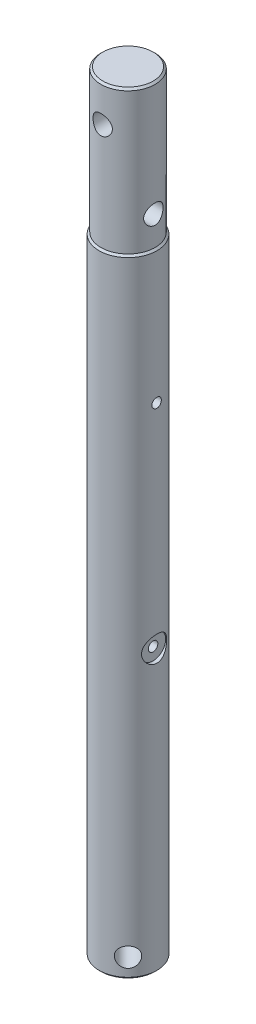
ISO-10303-21;
HEADER;
FILE_DESCRIPTION(('STEP AP214'),'2;1');
FILE_NAME('part.step','',(''),(''),'','','');
FILE_SCHEMA(('AUTOMOTIVE_DESIGN { 1 0 10303 214 1 1 1 1 }'));
ENDSEC;
DATA;
#1=APPLICATION_CONTEXT('core data for automotive mechanical design processes');
#2=APPLICATION_PROTOCOL_DEFINITION('international standard','automotive_design',2000,#1);
#3=PRODUCT_CONTEXT('',#1,'mechanical');
#4=PRODUCT('Part','Part','',(#3));
#5=PRODUCT_RELATED_PRODUCT_CATEGORY('part','',(#4));
#6=PRODUCT_DEFINITION_FORMATION('','',#4);
#7=PRODUCT_DEFINITION_CONTEXT('part definition',#1,'design');
#8=PRODUCT_DEFINITION('design','',#6,#7);
#9=PRODUCT_DEFINITION_SHAPE('','',#8);
#10=(LENGTH_UNIT() NAMED_UNIT(*) SI_UNIT(.MILLI.,.METRE.));
#11=(NAMED_UNIT(*) PLANE_ANGLE_UNIT() SI_UNIT($,.RADIAN.));
#12=(NAMED_UNIT(*) SI_UNIT($,.STERADIAN.) SOLID_ANGLE_UNIT());
#13=UNCERTAINTY_MEASURE_WITH_UNIT(LENGTH_MEASURE(1.E-05),#10,'distance_accuracy_value','');
#14=(GEOMETRIC_REPRESENTATION_CONTEXT(3) GLOBAL_UNCERTAINTY_ASSIGNED_CONTEXT((#13)) GLOBAL_UNIT_ASSIGNED_CONTEXT((#10,
#11,#12)) REPRESENTATION_CONTEXT('',''));
#15=CARTESIAN_POINT('',(0.,0.,0.));
#16=DIRECTION('',(0.,0.,1.));
#17=DIRECTION('',(1.,0.,0.));
#18=AXIS2_PLACEMENT_3D('',#15,#16,#17);
#19=CARTESIAN_POINT('',(12.95,-43.,0.));
#20=DIRECTION('',(-1.,0.,0.));
#21=DIRECTION('',(0.,0.,-1.));
#22=AXIS2_PLACEMENT_3D('',#19,#20,#21);
#23=CYLINDRICAL_SURFACE('',#22,2.4585);
#24=CARTESIAN_POINT('',(-5.63058436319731,-43.,0.));
#25=DIRECTION('',(-1.,0.,0.));
#26=DIRECTION('',(0.,0.,1.));
#27=AXIS2_PLACEMENT_3D('',#24,#25,#26);
#28=CIRCLE('',#27,2.4585);
#29=CARTESIAN_POINT('',(-5.63058436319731,-43.,2.4585));
#30=VERTEX_POINT('',#29);
#31=EDGE_CURVE('E128',#30,#30,#28,.T.);
#32=ORIENTED_EDGE('',*,*,#31,.T.);
#33=EDGE_LOOP('',(#32));
#34=FACE_BOUND('',#33,.T.);
#35=CARTESIAN_POINT('',(14.74646661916,-43.,2.4585));
#36=CARTESIAN_POINT('',(14.7464690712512,-43.1370895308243,2.45849446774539));
#37=CARTESIAN_POINT('',(14.7483989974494,-43.2742545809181,2.44699470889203));
#38=CARTESIAN_POINT('',(14.7559033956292,-43.5447379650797,2.40131842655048));
#39=CARTESIAN_POINT('',(14.7614812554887,-43.6780526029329,2.36712082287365));
#40=CARTESIAN_POINT('',(14.7756330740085,-43.9368814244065,2.27710969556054));
#41=CARTESIAN_POINT('',(14.7842045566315,-44.062401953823,2.2213140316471));
#42=CARTESIAN_POINT('',(14.8033749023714,-44.3022856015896,2.08973476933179));
#43=CARTESIAN_POINT('',(14.8139735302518,-44.4166500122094,2.01395348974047));
#44=CARTESIAN_POINT('',(14.8361176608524,-44.6320870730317,1.84377803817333));
#45=CARTESIAN_POINT('',(14.8476705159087,-44.7330370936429,1.74922955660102));
#46=CARTESIAN_POINT('',(14.8703560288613,-44.9177149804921,1.54453702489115));
#47=CARTESIAN_POINT('',(14.8814886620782,-45.0014418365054,1.43439206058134));
#48=CARTESIAN_POINT('',(14.9021570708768,-45.149755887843,1.20083982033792));
#49=CARTESIAN_POINT('',(14.9116831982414,-45.2142291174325,1.07735924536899));
#50=CARTESIAN_POINT('',(14.9279834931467,-45.3214733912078,0.821137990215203));
#51=CARTESIAN_POINT('',(14.9347578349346,-45.3642458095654,0.688397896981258));
#52=CARTESIAN_POINT('',(14.9447393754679,-45.4264996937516,0.418692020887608));
#53=CARTESIAN_POINT('',(14.9479780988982,-45.4461871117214,0.281774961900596));
#54=CARTESIAN_POINT('',(14.9506317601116,-45.462352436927,0.00654517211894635));
#55=CARTESIAN_POINT('',(14.9500469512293,-45.4588318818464,-0.131767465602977));
#56=CARTESIAN_POINT('',(14.9451444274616,-45.4288420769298,-0.40445449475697));
#57=CARTESIAN_POINT('',(14.94086276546,-45.402594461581,-0.538854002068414));
#58=CARTESIAN_POINT('',(14.9290878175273,-45.3282444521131,-0.801314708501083));
#59=CARTESIAN_POINT('',(14.9215944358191,-45.2801414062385,-0.929375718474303));
#60=CARTESIAN_POINT('',(14.9041765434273,-45.1632248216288,-1.17618500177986));
#61=CARTESIAN_POINT('',(14.8942413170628,-45.0943196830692,-1.29488909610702));
#62=CARTESIAN_POINT('',(14.873044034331,-44.9378219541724,-1.51913343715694));
#63=CARTESIAN_POINT('',(14.8617818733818,-44.8502278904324,-1.62467264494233));
#64=CARTESIAN_POINT('',(14.8390266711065,-44.6576087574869,-1.82090040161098));
#65=CARTESIAN_POINT('',(14.827532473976,-44.5523900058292,-1.91139879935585));
#66=CARTESIAN_POINT('',(14.8057374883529,-44.3281616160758,-2.07348656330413));
#67=CARTESIAN_POINT('',(14.7954367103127,-44.2091518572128,-2.14507576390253));
#68=CARTESIAN_POINT('',(14.7771943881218,-43.9605022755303,-2.26734873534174));
#69=CARTESIAN_POINT('',(14.7692553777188,-43.8308512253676,-2.31801007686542));
#70=CARTESIAN_POINT('',(14.7566777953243,-43.56471987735,-2.39678263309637));
#71=CARTESIAN_POINT('',(14.7520389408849,-43.428240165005,-2.42489577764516));
#72=CARTESIAN_POINT('',(14.7466414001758,-43.1540256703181,-2.45750712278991));
#73=CARTESIAN_POINT('',(14.7458382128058,-43.0163239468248,-2.46227617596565));
#74=CARTESIAN_POINT('',(14.7480844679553,-42.7420895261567,-2.44878531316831));
#75=CARTESIAN_POINT('',(14.7511337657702,-42.6055567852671,-2.43052626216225));
#76=CARTESIAN_POINT('',(14.7607003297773,-42.3383934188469,-2.37172826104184));
#77=CARTESIAN_POINT('',(14.7671961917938,-42.2077317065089,-2.33132677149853));
#78=CARTESIAN_POINT('',(14.7829060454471,-41.9550336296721,-2.22953474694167));
#79=CARTESIAN_POINT('',(14.7921201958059,-41.8329977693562,-2.16814298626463));
#80=CARTESIAN_POINT('',(14.812332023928,-41.5998088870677,-2.02547226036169));
#81=CARTESIAN_POINT('',(14.823344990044,-41.4887635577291,-1.9440194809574));
#82=CARTESIAN_POINT('',(14.8458686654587,-41.2818204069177,-1.76377785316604));
#83=CARTESIAN_POINT('',(14.857379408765,-41.1859236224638,-1.6649878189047));
#84=CARTESIAN_POINT('',(14.8797421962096,-41.0110129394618,-1.45167696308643));
#85=CARTESIAN_POINT('',(14.8905864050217,-40.9321795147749,-1.33700721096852));
#86=CARTESIAN_POINT('',(14.9102691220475,-40.7948965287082,-1.09589432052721));
#87=CARTESIAN_POINT('',(14.9191076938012,-40.7364463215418,-0.969451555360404));
#88=CARTESIAN_POINT('',(14.9337491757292,-40.6418708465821,-0.708921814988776));
#89=CARTESIAN_POINT('',(14.9395649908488,-40.6056505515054,-0.57487009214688));
#90=CARTESIAN_POINT('',(14.9475601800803,-40.5562568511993,-0.302483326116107));
#91=CARTESIAN_POINT('',(14.9497398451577,-40.5430816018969,-0.164148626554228));
#92=CARTESIAN_POINT('',(14.9502131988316,-40.5402039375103,0.111134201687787));
#93=CARTESIAN_POINT('',(14.9485523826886,-40.5502267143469,0.248079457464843));
#94=CARTESIAN_POINT('',(14.9416241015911,-40.5928669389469,0.518308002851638));
#95=CARTESIAN_POINT('',(14.9363566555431,-40.6254842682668,0.651591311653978));
#96=CARTESIAN_POINT('',(14.922804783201,-40.7122833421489,0.910611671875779));
#97=CARTESIAN_POINT('',(14.9145235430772,-40.7664423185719,1.03635652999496));
#98=CARTESIAN_POINT('',(14.8958488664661,-40.8947569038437,1.27701694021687));
#99=CARTESIAN_POINT('',(14.8854553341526,-40.9689134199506,1.39193200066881));
#100=CARTESIAN_POINT('',(14.8635626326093,-41.1360949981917,1.60905648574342));
#101=CARTESIAN_POINT('',(14.8520524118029,-41.2293215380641,1.71110967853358));
#102=CARTESIAN_POINT('',(14.8293008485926,-41.4315737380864,1.89822109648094));
#103=CARTESIAN_POINT('',(14.8180595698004,-41.5406030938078,1.98327533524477));
#104=CARTESIAN_POINT('',(14.7970353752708,-41.7722538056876,2.13450949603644));
#105=CARTESIAN_POINT('',(14.7872630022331,-41.8949633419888,2.20055582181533));
#106=CARTESIAN_POINT('',(14.7704075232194,-42.1498445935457,2.31099746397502));
#107=CARTESIAN_POINT('',(14.7633217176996,-42.2820066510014,2.35541452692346));
#108=CARTESIAN_POINT('',(14.7542222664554,-42.5122455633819,2.41162983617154));
#109=CARTESIAN_POINT('',(14.75132996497,-42.6089242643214,2.42917813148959));
#110=CARTESIAN_POINT('',(14.7474512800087,-42.8037224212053,2.45261509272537));
#111=CARTESIAN_POINT('',(14.7464648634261,-42.9018418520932,2.45850396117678));
#112=CARTESIAN_POINT('',(14.74646661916,-43.,2.4585));
#113=B_SPLINE_CURVE_WITH_KNOTS('',3,(#35,#36,#37,#38,#39,#40,#41,#42,#43,#44,#45,#46,#47,#48,
#49,#50,#51,#52,#53,#54,#55,#56,#57,#58,#59,#60,#61,#62,#63,#64,#65,#66,#67,#68,#69,#70,#71,#72,
#73,#74,#75,#76,#77,#78,#79,#80,#81,#82,#83,#84,#85,#86,#87,#88,#89,#90,#91,#92,#93,#94,#95,#96,
#97,#98,#99,#100,#101,#102,#103,#104,#105,#106,#107,#108,#109,#110,#111,#112),.UNSPECIFIED.,.T.,
.F.,(4,2,2,2,2,2,2,2,2,2,2,2,2,2,2,2,2,2,2,2,2,2,2,2,2,2,2,2,2,2,2,2,2,2,2,2,2,2,4),(0.,
0.410909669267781,0.822201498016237,1.2331539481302,1.64405873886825,2.05849359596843,
2.4729527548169,2.88981864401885,3.30665813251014,3.71974980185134,4.13281410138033,
4.54189499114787,4.95098808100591,5.36190951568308,5.77286335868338,6.18867162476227,
6.60448353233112,7.02073993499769,7.4369607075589,7.8483405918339,8.25970502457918,
8.66854416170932,9.07740717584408,9.48994564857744,9.90251235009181,10.3192497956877,
10.7359740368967,11.1509042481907,11.5658012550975,11.9758085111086,12.3858136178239,
12.7953865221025,13.2049780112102,13.6191438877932,14.0334067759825,14.4505139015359,
14.8672007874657,15.1614233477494,15.4556407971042),.UNSPECIFIED.);
#114=CARTESIAN_POINT('',(14.74646661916,-43.,2.4585));
#115=VERTEX_POINT('',#114);
#116=EDGE_CURVE('E123',#115,#115,#113,.T.);
#117=ORIENTED_EDGE('',*,*,#116,.T.);
#118=EDGE_LOOP('',(#117));
#119=FACE_BOUND('',#118,.T.);
#120=ADVANCED_FACE('F14',(#34,#119),#23,.F.);
#121=CARTESIAN_POINT('',(-5.63058436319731,-43.,0.));
#122=DIRECTION('',(1.,0.,0.));
#123=DIRECTION('',(0.,0.,1.));
#124=AXIS2_PLACEMENT_3D('',#121,#122,#123);
#125=CONICAL_SURFACE('',#124,2.4585,1.0471975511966);
#126=ORIENTED_EDGE('',*,*,#31,.F.);
#127=EDGE_LOOP('',(#126));
#128=FACE_BOUND('',#127,.T.);
#129=CARTESIAN_POINT('',(-7.05000000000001,-43.,0.));
#130=VERTEX_POINT('',#129);
#131=VERTEX_LOOP('',#130);
#132=FACE_BOUND('',#131,.T.);
#133=ADVANCED_FACE('F34',(#128,#132),#125,.F.);
#134=CARTESIAN_POINT('',(0.,-60.,0.));
#135=DIRECTION('',(0.,-1.,0.));
#136=DIRECTION('',(0.,0.,-1.));
#137=AXIS2_PLACEMENT_3D('',#134,#135,#136);
#138=CYLINDRICAL_SURFACE('',#137,14.95);
#139=CARTESIAN_POINT('',(13.4980260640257,-288.,6.42695825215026));
#140=CARTESIAN_POINT('',(13.4980263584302,-288.2722827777,6.42695645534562));
#141=CARTESIAN_POINT('',(13.4878881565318,-288.544556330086,6.44838069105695));
#142=CARTESIAN_POINT('',(13.4472390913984,-289.08103336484,6.53271788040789));
#143=CARTESIAN_POINT('',(13.4167249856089,-289.34523555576,6.59563743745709));
#144=CARTESIAN_POINT('',(13.3351145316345,-289.857710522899,6.75910264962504));
#145=CARTESIAN_POINT('',(13.2840587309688,-290.10601356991,6.85957415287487));
#146=CARTESIAN_POINT('',(13.1609030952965,-290.58120060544,7.09298812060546));
#147=CARTESIAN_POINT('',(13.088798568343,-290.808079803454,7.22593782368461));
#148=CARTESIAN_POINT('',(12.9200457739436,-291.242916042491,7.5236400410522));
#149=CARTESIAN_POINT('',(12.8226119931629,-291.449906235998,7.68935985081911));
#150=CARTESIAN_POINT('',(12.6041906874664,-291.830402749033,8.04238211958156));
#151=CARTESIAN_POINT('',(12.4831993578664,-292.003903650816,8.22968806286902));
#152=CARTESIAN_POINT('',(12.2143515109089,-292.316890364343,8.62382832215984));
#153=CARTESIAN_POINT('',(12.0658724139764,-292.45536217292,8.83104654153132));
#154=CARTESIAN_POINT('',(11.7457680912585,-292.687648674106,9.25253099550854));
#155=CARTESIAN_POINT('',(11.5741491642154,-292.781475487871,9.46679530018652));
#156=CARTESIAN_POINT('',(11.2173642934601,-292.918527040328,9.886680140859));
#157=CARTESIAN_POINT('',(11.0328829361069,-292.963408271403,10.0923406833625));
#158=CARTESIAN_POINT('',(10.6500934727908,-293.006562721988,10.4954842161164));
#159=CARTESIAN_POINT('',(10.4517889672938,-293.00484803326,10.6929693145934));
#160=CARTESIAN_POINT('',(10.0555554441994,-292.955907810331,11.0661422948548));
#161=CARTESIAN_POINT('',(9.85792069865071,-292.910481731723,11.2423829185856));
#162=CARTESIAN_POINT('',(9.46188988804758,-292.778385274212,11.5776722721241));
#163=CARTESIAN_POINT('',(9.26349377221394,-292.691712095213,11.7367198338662));
#164=CARTESIAN_POINT('',(8.86991250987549,-292.478536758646,12.036996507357));
#165=CARTESIAN_POINT('',(8.67480422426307,-292.351524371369,12.1779629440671));
#166=CARTESIAN_POINT('',(8.29718056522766,-292.061697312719,12.4383270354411));
#167=CARTESIAN_POINT('',(8.11466872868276,-291.898872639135,12.5577186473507));
#168=CARTESIAN_POINT('',(7.76051610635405,-291.532985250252,12.7797753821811));
#169=CARTESIAN_POINT('',(7.5898000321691,-291.328381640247,12.8813800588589));
#170=CARTESIAN_POINT('',(7.27646597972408,-290.889373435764,13.0609431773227));
#171=CARTESIAN_POINT('',(7.13385239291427,-290.654964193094,13.138897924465));
#172=CARTESIAN_POINT('',(6.88175466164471,-290.158523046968,13.2727049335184));
#173=CARTESIAN_POINT('',(6.7727785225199,-289.896141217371,13.3282218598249));
#174=CARTESIAN_POINT('',(6.59711243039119,-289.353933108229,13.4160488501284));
#175=CARTESIAN_POINT('',(6.53040461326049,-289.074114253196,13.4483687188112));
#176=CARTESIAN_POINT('',(6.44556718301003,-288.518579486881,13.4892287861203));
#177=CARTESIAN_POINT('',(6.42537031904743,-288.243253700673,13.4987816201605));
#178=CARTESIAN_POINT('',(6.4287410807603,-287.692960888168,13.4971777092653));
#179=CARTESIAN_POINT('',(6.45230068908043,-287.417993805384,13.4860247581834));
#180=CARTESIAN_POINT('',(6.54008276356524,-286.886161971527,13.4436611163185));
#181=CARTESIAN_POINT('',(6.60286748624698,-286.629000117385,13.413159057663));
#182=CARTESIAN_POINT('',(6.76426582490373,-286.129448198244,13.3324900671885));
#183=CARTESIAN_POINT('',(6.86288581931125,-285.887060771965,13.2823196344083));
#184=CARTESIAN_POINT('',(7.09476439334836,-285.415374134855,13.159957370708));
#185=CARTESIAN_POINT('',(7.22902698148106,-285.18673848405,13.0871145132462));
#186=CARTESIAN_POINT('',(7.52451341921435,-284.7564993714,12.9194816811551));
#187=CARTESIAN_POINT('',(7.68574526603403,-284.554903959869,12.82468519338));
#188=CARTESIAN_POINT('',(8.03711211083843,-284.1743644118,12.6076140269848));
#189=CARTESIAN_POINT('',(8.22826947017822,-283.996992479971,12.484229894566));
#190=CARTESIAN_POINT('',(8.62553866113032,-283.681984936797,12.2131212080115));
#191=CARTESIAN_POINT('',(8.83164997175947,-283.54434794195,12.0653975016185));
#192=CARTESIAN_POINT('',(9.24951659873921,-283.31397033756,11.748073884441));
#193=CARTESIAN_POINT('',(9.46122577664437,-283.220939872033,11.5786245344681));
#194=CARTESIAN_POINT('',(9.88357588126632,-283.081911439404,11.2202493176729));
#195=CARTESIAN_POINT('',(10.0942171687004,-283.035896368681,11.0313305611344));
#196=CARTESIAN_POINT('',(10.4970875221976,-282.993752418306,10.648345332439));
#197=CARTESIAN_POINT('',(10.6897162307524,-282.995367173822,10.4549448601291));
#198=CARTESIAN_POINT('',(11.0614810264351,-283.042865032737,10.0607910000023));
#199=CARTESIAN_POINT('',(11.2406182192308,-283.088744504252,9.86003821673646));
#200=CARTESIAN_POINT('',(11.5783766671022,-283.221969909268,9.46102509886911));
#201=CARTESIAN_POINT('',(11.7372815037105,-283.3086371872,9.26277659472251));
#202=CARTESIAN_POINT('',(12.0353565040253,-283.520348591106,8.87204301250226));
#203=CARTESIAN_POINT('',(12.1745230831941,-283.645399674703,8.6795589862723));
#204=CARTESIAN_POINT('',(12.436636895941,-283.935668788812,8.29986615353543));
#205=CARTESIAN_POINT('',(12.5587907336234,-284.102205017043,8.11311807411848));
#206=CARTESIAN_POINT('',(12.7802330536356,-284.468479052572,7.75962187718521));
#207=CARTESIAN_POINT('',(12.8795141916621,-284.668227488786,7.59288019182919));
#208=CARTESIAN_POINT('',(13.0589909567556,-285.1046847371,7.28004836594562));
#209=CARTESIAN_POINT('',(13.1382782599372,-285.342541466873,7.13503354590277));
#210=CARTESIAN_POINT('',(13.2730575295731,-285.842981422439,6.88107653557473));
#211=CARTESIAN_POINT('',(13.3285555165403,-286.105558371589,6.77212522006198));
#212=CARTESIAN_POINT('',(13.4144489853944,-286.636537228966,6.60029874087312));
#213=CARTESIAN_POINT('',(13.4458208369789,-286.904203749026,6.53564451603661));
#214=CARTESIAN_POINT('',(13.4876055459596,-287.447918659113,6.44898267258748));
#215=CARTESIAN_POINT('',(13.4980257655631,-287.723964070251,6.4269600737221));
#216=CARTESIAN_POINT('',(13.4980260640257,-288.,6.42695825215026));
#217=B_SPLINE_CURVE_WITH_KNOTS('',3,(#139,#140,#141,#142,#143,#144,#145,#146,#147,#148,#149,
#150,#151,#152,#153,#154,#155,#156,#157,#158,#159,#160,#161,#162,#163,#164,#165,#166,#167,#168,
#169,#170,#171,#172,#173,#174,#175,#176,#177,#178,#179,#180,#181,#182,#183,#184,#185,#186,#187,
#188,#189,#190,#191,#192,#193,#194,#195,#196,#197,#198,#199,#200,#201,#202,#203,#204,#205,#206,
#207,#208,#209,#210,#211,#212,#213,#214,#215,#216),.UNSPECIFIED.,.T.,.F.,(4,2,2,2,2,2,2,2,2,2,2,
2,2,2,2,2,2,2,2,2,2,2,2,2,2,2,2,2,2,2,2,2,2,2,2,2,2,2,4),(0.,0.815825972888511,1.63178180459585,
2.44613485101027,3.26066956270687,4.10433349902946,4.94813380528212,5.81411427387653,
6.67985949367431,7.51529659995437,8.35051691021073,9.15276245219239,9.95506246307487,
10.7679440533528,11.58105296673,12.4326848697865,13.2844497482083,14.1485113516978,
15.0122075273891,15.836706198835,16.6610538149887,17.4568282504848,18.2527443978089,
19.0740332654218,19.8955661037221,20.7569318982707,21.6182676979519,22.4739279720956,
23.3292768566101,24.1441734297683,24.9590031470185,25.7607301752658,26.5626026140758,
27.3942277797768,28.2261196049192,29.0908570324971,29.9553754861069,30.7827376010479,
31.6098089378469),.UNSPECIFIED.);
#218=CARTESIAN_POINT('',(13.4980260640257,-288.,6.42695825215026));
#219=VERTEX_POINT('',#218);
#220=EDGE_CURVE('E19',#219,#219,#217,.T.);
#221=ORIENTED_EDGE('',*,*,#220,.T.);
#222=EDGE_LOOP('',(#221));
#223=FACE_BOUND('',#222,.T.);
#224=CARTESIAN_POINT('',(-6.42695825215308,-288.,-13.4980260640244));
#225=CARTESIAN_POINT('',(-6.42695645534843,-287.7277172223,-13.4980263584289));
#226=CARTESIAN_POINT('',(-6.44838069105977,-287.455443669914,-13.4878881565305));
#227=CARTESIAN_POINT('',(-6.5327178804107,-286.91896663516,-13.4472390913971));
#228=CARTESIAN_POINT('',(-6.5956374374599,-286.65476444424,-13.4167249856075));
#229=CARTESIAN_POINT('',(-6.75910264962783,-286.142289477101,-13.3351145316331));
#230=CARTESIAN_POINT('',(-6.85957415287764,-285.89398643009,-13.2840587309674));
#231=CARTESIAN_POINT('',(-7.09298812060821,-285.41879939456,-13.1609030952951));
#232=CARTESIAN_POINT('',(-7.22593782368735,-285.191920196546,-13.0887985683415));
#233=CARTESIAN_POINT('',(-7.5236400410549,-284.757083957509,-12.9200457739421));
#234=CARTESIAN_POINT('',(-7.68935985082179,-284.550093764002,-12.8226119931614));
#235=CARTESIAN_POINT('',(-8.04238211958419,-284.169597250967,-12.6041906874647));
#236=CARTESIAN_POINT('',(-8.22968806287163,-283.996096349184,-12.4831993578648));
#237=CARTESIAN_POINT('',(-8.6238283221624,-283.683109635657,-12.2143515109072));
#238=CARTESIAN_POINT('',(-8.83104654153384,-283.54463782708,-12.0658724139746));
#239=CARTESIAN_POINT('',(-9.25253099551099,-283.312351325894,-11.7457680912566));
#240=CARTESIAN_POINT('',(-9.46679530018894,-283.218524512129,-11.5741491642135));
#241=CARTESIAN_POINT('',(-9.88668014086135,-283.081472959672,-11.2173642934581));
#242=CARTESIAN_POINT('',(-10.0923406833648,-283.036591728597,-11.0328829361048));
#243=CARTESIAN_POINT('',(-10.4954842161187,-282.993437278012,-10.6500934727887));
#244=CARTESIAN_POINT('',(-10.6929693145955,-282.99515196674,-10.4517889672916));
#245=CARTESIAN_POINT('',(-11.066142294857,-283.044092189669,-10.0555554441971));
#246=CARTESIAN_POINT('',(-11.2423829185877,-283.089518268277,-9.85792069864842));
#247=CARTESIAN_POINT('',(-11.5776722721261,-283.221614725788,-9.46188988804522));
#248=CARTESIAN_POINT('',(-11.7367198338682,-283.308287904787,-9.26349377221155));
#249=CARTESIAN_POINT('',(-12.0369965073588,-283.521463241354,-8.86991250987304));
#250=CARTESIAN_POINT('',(-12.1779629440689,-283.648475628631,-8.67480422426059));
#251=CARTESIAN_POINT('',(-12.4383270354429,-283.938302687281,-8.29718056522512));
#252=CARTESIAN_POINT('',(-12.5577186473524,-284.101127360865,-8.11466872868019));
#253=CARTESIAN_POINT('',(-12.7797753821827,-284.467014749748,-7.76051610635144));
#254=CARTESIAN_POINT('',(-12.8813800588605,-284.671618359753,-7.58980003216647));
#255=CARTESIAN_POINT('',(-13.0609431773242,-285.110626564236,-7.27646597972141));
#256=CARTESIAN_POINT('',(-13.1388979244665,-285.345035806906,-7.13385239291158));
#257=CARTESIAN_POINT('',(-13.2727049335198,-285.841476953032,-6.88175466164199));
#258=CARTESIAN_POINT('',(-13.3282218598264,-286.103858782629,-6.77277852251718));
#259=CARTESIAN_POINT('',(-13.4160488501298,-286.646066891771,-6.59711243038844));
#260=CARTESIAN_POINT('',(-13.4483687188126,-286.925885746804,-6.53040461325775));
#261=CARTESIAN_POINT('',(-13.4892287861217,-287.481420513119,-6.44556718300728));
#262=CARTESIAN_POINT('',(-13.4987816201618,-287.756746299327,-6.42537031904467));
#263=CARTESIAN_POINT('',(-13.4971777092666,-288.307039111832,-6.42874108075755));
#264=CARTESIAN_POINT('',(-13.4860247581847,-288.582006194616,-6.45230068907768));
#265=CARTESIAN_POINT('',(-13.4436611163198,-289.113838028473,-6.54008276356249));
#266=CARTESIAN_POINT('',(-13.4131590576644,-289.370999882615,-6.60286748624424));
#267=CARTESIAN_POINT('',(-13.3324900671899,-289.870551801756,-6.764265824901));
#268=CARTESIAN_POINT('',(-13.2823196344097,-290.112939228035,-6.86288581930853));
#269=CARTESIAN_POINT('',(-13.1599573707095,-290.584625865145,-7.09476439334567));
#270=CARTESIAN_POINT('',(-13.0871145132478,-290.813261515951,-7.22902698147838));
#271=CARTESIAN_POINT('',(-12.9194816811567,-291.2435006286,-7.52451341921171));
#272=CARTESIAN_POINT('',(-12.8246851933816,-291.445096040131,-7.68574526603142));
#273=CARTESIAN_POINT('',(-12.6076140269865,-291.8256355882,-8.03711211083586));
#274=CARTESIAN_POINT('',(-12.4842298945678,-292.003007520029,-8.22826947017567));
#275=CARTESIAN_POINT('',(-12.2131212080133,-292.318015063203,-8.62553866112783));
#276=CARTESIAN_POINT('',(-12.0653975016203,-292.45565205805,-8.83164997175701));
#277=CARTESIAN_POINT('',(-11.7480738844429,-292.68602966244,-9.24951659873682));
#278=CARTESIAN_POINT('',(-11.5786245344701,-292.779060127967,-9.46122577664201));
#279=CARTESIAN_POINT('',(-11.220249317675,-292.918088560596,-9.88357588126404));
#280=CARTESIAN_POINT('',(-11.0313305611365,-292.964103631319,-10.0942171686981));
#281=CARTESIAN_POINT('',(-10.6483453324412,-293.006247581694,-10.4970875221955));
#282=CARTESIAN_POINT('',(-10.4549448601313,-293.004632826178,-10.6897162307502));
#283=CARTESIAN_POINT('',(-10.0607910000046,-292.957134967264,-11.061481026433));
#284=CARTESIAN_POINT('',(-9.86003821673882,-292.911255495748,-11.2406182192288));
#285=CARTESIAN_POINT('',(-9.46102509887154,-292.778030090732,-11.5783766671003));
#286=CARTESIAN_POINT('',(-9.26277659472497,-292.6913628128,-11.7372815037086));
#287=CARTESIAN_POINT('',(-8.87204301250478,-292.479651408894,-12.0353565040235));
#288=CARTESIAN_POINT('',(-8.67955898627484,-292.354600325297,-12.1745230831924));
#289=CARTESIAN_POINT('',(-8.29986615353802,-292.064331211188,-12.4366368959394));
#290=CARTESIAN_POINT('',(-8.11311807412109,-291.897794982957,-12.5587907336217));
#291=CARTESIAN_POINT('',(-7.75962187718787,-291.531520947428,-12.780233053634));
#292=CARTESIAN_POINT('',(-7.59288019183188,-291.331772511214,-12.8795141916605));
#293=CARTESIAN_POINT('',(-7.28004836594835,-290.8953152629,-13.0589909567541));
#294=CARTESIAN_POINT('',(-7.13503354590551,-290.657458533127,-13.1382782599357));
#295=CARTESIAN_POINT('',(-6.88107653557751,-290.157018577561,-13.2730575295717));
#296=CARTESIAN_POINT('',(-6.77212522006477,-289.894441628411,-13.3285555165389));
#297=CARTESIAN_POINT('',(-6.60029874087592,-289.363462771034,-13.414448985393));
#298=CARTESIAN_POINT('',(-6.53564451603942,-289.095796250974,-13.4458208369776));
#299=CARTESIAN_POINT('',(-6.4489826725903,-288.552081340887,-13.4876055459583));
#300=CARTESIAN_POINT('',(-6.42696007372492,-288.276035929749,-13.4980257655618));
#301=CARTESIAN_POINT('',(-6.42695825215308,-288.,-13.4980260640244));
#302=B_SPLINE_CURVE_WITH_KNOTS('',3,(#224,#225,#226,#227,#228,#229,#230,#231,#232,#233,#234,
#235,#236,#237,#238,#239,#240,#241,#242,#243,#244,#245,#246,#247,#248,#249,#250,#251,#252,#253,
#254,#255,#256,#257,#258,#259,#260,#261,#262,#263,#264,#265,#266,#267,#268,#269,#270,#271,#272,
#273,#274,#275,#276,#277,#278,#279,#280,#281,#282,#283,#284,#285,#286,#287,#288,#289,#290,#291,
#292,#293,#294,#295,#296,#297,#298,#299,#300,#301),.UNSPECIFIED.,.T.,.F.,(4,2,2,2,2,2,2,2,2,2,2,
2,2,2,2,2,2,2,2,2,2,2,2,2,2,2,2,2,2,2,2,2,2,2,2,2,2,2,4),(0.,0.815825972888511,1.63178180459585,
2.44613485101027,3.26066956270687,4.10433349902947,4.94813380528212,5.81411427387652,
6.67985949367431,7.51529659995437,8.35051691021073,9.15276245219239,9.95506246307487,
10.7679440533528,11.58105296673,12.4326848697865,13.2844497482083,14.1485113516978,
15.0122075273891,15.836706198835,16.6610538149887,17.4568282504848,18.2527443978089,
19.0740332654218,19.8955661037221,20.7569318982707,21.6182676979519,22.4739279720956,
23.3292768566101,24.1441734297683,24.9590031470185,25.7607301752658,26.5626026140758,
27.3942277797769,28.2261196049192,29.0908570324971,29.9553754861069,30.7827376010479,
31.6098089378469),.UNSPECIFIED.);
#303=CARTESIAN_POINT('',(-6.42695825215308,-288.,-13.4980260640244));
#304=VERTEX_POINT('',#303);
#305=EDGE_CURVE('E378',#304,#304,#302,.T.);
#306=ORIENTED_EDGE('',*,*,#305,.T.);
#307=EDGE_LOOP('',(#306));
#308=FACE_BOUND('',#307,.T.);
#309=CARTESIAN_POINT('',(0.,25.05,0.));
#310=DIRECTION('',(0.,-1.,0.));
#311=DIRECTION('',(0.,0.,-1.));
#312=AXIS2_PLACEMENT_3D('',#309,#310,#311);
#313=CIRCLE('',#312,14.95);
#314=CARTESIAN_POINT('',(0.,25.05,-14.95));
#315=VERTEX_POINT('',#314);
#316=EDGE_CURVE('E146',#315,#315,#313,.T.);
#317=ORIENTED_EDGE('',*,*,#316,.T.);
#318=EDGE_LOOP('',(#317));
#319=FACE_BOUND('',#318,.T.);
#320=CARTESIAN_POINT('',(0.,-297.,0.));
#321=DIRECTION('',(0.,-1.,0.));
#322=DIRECTION('',(0.,0.,-1.));
#323=AXIS2_PLACEMENT_3D('',#320,#321,#322);
#324=CIRCLE('',#323,14.95);
#325=CARTESIAN_POINT('',(0.,-297.,-14.95));
#326=VERTEX_POINT('',#325);
#327=EDGE_CURVE('E143',#326,#326,#324,.T.);
#328=ORIENTED_EDGE('',*,*,#327,.F.);
#329=EDGE_LOOP('',(#328));
#330=FACE_BOUND('',#329,.T.);
#331=CARTESIAN_POINT('',(14.95,-159.5,0.));
#332=CARTESIAN_POINT('',(14.9499989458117,-159.499998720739,0.17349667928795));
#333=CARTESIAN_POINT('',(14.9469717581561,-159.493044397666,0.347042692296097));
#334=CARTESIAN_POINT('',(14.934938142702,-159.465294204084,0.692890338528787));
#335=CARTESIAN_POINT('',(14.9259281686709,-159.44449012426,0.865191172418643));
#336=CARTESIAN_POINT('',(14.9021430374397,-159.389208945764,1.20752884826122));
#337=CARTESIAN_POINT('',(14.8873567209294,-159.354705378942,1.37756064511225));
#338=CARTESIAN_POINT('',(14.8523991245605,-159.272371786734,1.7138665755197));
#339=CARTESIAN_POINT('',(14.8322256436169,-159.224536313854,1.88013914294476));
#340=CARTESIAN_POINT('',(14.7871003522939,-159.116228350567,2.20710050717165));
#341=CARTESIAN_POINT('',(14.7621677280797,-159.055806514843,2.36780876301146));
#342=CARTESIAN_POINT('',(14.7080761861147,-158.922727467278,2.68340135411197));
#343=CARTESIAN_POINT('',(14.6789156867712,-158.850065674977,2.83828348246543));
#344=CARTESIAN_POINT('',(14.617088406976,-158.693151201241,3.14119343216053));
#345=CARTESIAN_POINT('',(14.5844240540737,-158.608906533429,3.28922589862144));
#346=CARTESIAN_POINT('',(14.5163310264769,-158.429388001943,3.57780066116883));
#347=CARTESIAN_POINT('',(14.4809013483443,-158.334110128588,3.71834020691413));
#348=CARTESIAN_POINT('',(14.3681139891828,-158.02283695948,4.14092620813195));
#349=CARTESIAN_POINT('',(14.287367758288,-157.788999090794,4.40921864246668));
#350=CARTESIAN_POINT('',(14.1251400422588,-157.28076382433,4.90418034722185));
#351=CARTESIAN_POINT('',(14.0436581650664,-157.006343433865,5.13082585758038));
#352=CARTESIAN_POINT('',(13.9251623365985,-156.560854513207,5.44109780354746));
#353=CARTESIAN_POINT('',(13.8853142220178,-156.40214920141,5.54173222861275));
#354=CARTESIAN_POINT('',(13.8090306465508,-156.076024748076,5.729171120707));
#355=CARTESIAN_POINT('',(13.7725937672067,-155.908609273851,5.81598134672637));
#356=CARTESIAN_POINT('',(13.7043461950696,-155.566080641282,5.97502244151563));
#357=CARTESIAN_POINT('',(13.6725355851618,-155.390967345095,6.04725304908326));
#358=CARTESIAN_POINT('',(13.6147006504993,-155.034330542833,6.17636092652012));
#359=CARTESIAN_POINT('',(13.5886732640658,-154.852810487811,6.23324632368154));
#360=CARTESIAN_POINT('',(13.5445375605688,-154.494011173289,6.32855599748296));
#361=CARTESIAN_POINT('',(13.5260949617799,-154.316982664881,6.36776927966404));
#362=CARTESIAN_POINT('',(13.4960006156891,-153.95978025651,6.43130688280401));
#363=CARTESIAN_POINT('',(13.4843456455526,-153.779607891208,6.45563827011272));
#364=CARTESIAN_POINT('',(13.4682662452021,-153.417592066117,6.48911789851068));
#365=CARTESIAN_POINT('',(13.4638395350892,-153.235749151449,6.49827092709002));
#366=CARTESIAN_POINT('',(13.4623854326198,-152.871912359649,6.50128325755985));
#367=CARTESIAN_POINT('',(13.4653575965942,-152.689918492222,6.49514347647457));
#368=CARTESIAN_POINT('',(13.4780158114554,-152.342814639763,6.46883095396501));
#369=CARTESIAN_POINT('',(13.4871083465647,-152.177587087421,6.4498982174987));
#370=CARTESIAN_POINT('',(13.5110893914,-151.849425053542,6.39951106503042));
#371=CARTESIAN_POINT('',(13.5259797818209,-151.686491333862,6.36805258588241));
#372=CARTESIAN_POINT('',(13.5610850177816,-151.364088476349,6.29294739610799));
#373=CARTESIAN_POINT('',(13.5812987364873,-151.204618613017,6.24930326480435));
#374=CARTESIAN_POINT('',(13.626455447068,-150.890014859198,6.15021738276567));
#375=CARTESIAN_POINT('',(13.6514002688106,-150.734882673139,6.094771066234));
#376=CARTESIAN_POINT('',(13.7058942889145,-150.426566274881,5.97123226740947));
#377=CARTESIAN_POINT('',(13.7355315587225,-150.273497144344,5.90289175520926));
#378=CARTESIAN_POINT('',(13.7981923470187,-149.97359471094,5.75489739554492));
#379=CARTESIAN_POINT('',(13.8312170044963,-149.826763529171,5.67523973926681));
#380=CARTESIAN_POINT('',(13.8997922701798,-149.540071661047,5.50515044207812));
#381=CARTESIAN_POINT('',(13.9353432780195,-149.400212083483,5.41471709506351));
#382=CARTESIAN_POINT('',(14.0080968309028,-149.12811841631,5.22361712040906));
#383=CARTESIAN_POINT('',(14.0452994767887,-148.995884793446,5.12294986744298));
#384=CARTESIAN_POINT('',(14.1239880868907,-148.727709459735,4.90208609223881));
#385=CARTESIAN_POINT('',(14.165550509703,-148.592567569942,4.78094398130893));
#386=CARTESIAN_POINT('',(14.2484831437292,-148.332890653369,4.52779876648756));
#387=CARTESIAN_POINT('',(14.2898534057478,-148.208352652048,4.39579872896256));
#388=CARTESIAN_POINT('',(14.3713584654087,-147.970493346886,4.12153266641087));
#389=CARTESIAN_POINT('',(14.4114924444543,-147.857179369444,3.97926003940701));
#390=CARTESIAN_POINT('',(14.4894355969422,-147.642647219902,3.68535726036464));
#391=CARTESIAN_POINT('',(14.5272456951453,-147.541424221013,3.53373087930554));
#392=CARTESIAN_POINT('',(14.6005686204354,-147.349139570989,3.21759880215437));
#393=CARTESIAN_POINT('',(14.6359888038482,-147.258437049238,3.05285269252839));
#394=CARTESIAN_POINT('',(14.7023259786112,-147.091382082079,2.71544738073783));
#395=CARTESIAN_POINT('',(14.7332448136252,-147.015023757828,2.54279145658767));
#396=CARTESIAN_POINT('',(14.7896869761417,-146.877395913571,2.19075886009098));
#397=CARTESIAN_POINT('',(14.8152117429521,-146.816122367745,2.01138399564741));
#398=CARTESIAN_POINT('',(14.8601039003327,-146.709329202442,1.64725529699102));
#399=CARTESIAN_POINT('',(14.8794718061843,-146.663808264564,1.46250191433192));
#400=CARTESIAN_POINT('',(14.9103685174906,-146.591601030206,1.10178607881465));
#401=CARTESIAN_POINT('',(14.9223389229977,-146.563849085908,0.926074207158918));
#402=CARTESIAN_POINT('',(14.940075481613,-146.522832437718,0.572660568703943));
#403=CARTESIAN_POINT('',(14.9458420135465,-146.509566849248,0.394958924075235));
#404=CARTESIAN_POINT('',(14.9510083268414,-146.497679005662,0.0390223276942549));
#405=CARTESIAN_POINT('',(14.9504098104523,-146.499052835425,-0.139212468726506));
#406=CARTESIAN_POINT('',(14.9428668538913,-146.516418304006,-0.494830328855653));
#407=CARTESIAN_POINT('',(14.9359225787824,-146.532409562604,-0.672213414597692));
#408=CARTESIAN_POINT('',(14.9164396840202,-146.577534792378,-1.01496220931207));
#409=CARTESIAN_POINT('',(14.9042318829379,-146.605892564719,-1.1804497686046));
#410=CARTESIAN_POINT('',(14.8746260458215,-146.675208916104,-1.50834558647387));
#411=CARTESIAN_POINT('',(14.8572263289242,-146.716171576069,-1.6707528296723));
#412=CARTESIAN_POINT('',(14.8176632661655,-146.810293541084,-1.99134049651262));
#413=CARTESIAN_POINT('',(14.7955012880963,-146.863449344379,-2.1495221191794));
#414=CARTESIAN_POINT('',(14.7469213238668,-146.981521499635,-2.46082127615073));
#415=CARTESIAN_POINT('',(14.7205017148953,-147.046442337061,-2.61393685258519));
#416=CARTESIAN_POINT('',(14.663141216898,-147.189694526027,-2.91883373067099));
#417=CARTESIAN_POINT('',(14.6320859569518,-147.2683779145,-3.07042802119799));
#418=CARTESIAN_POINT('',(14.5668171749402,-147.437112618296,-3.36650105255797));
#419=CARTESIAN_POINT('',(14.532602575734,-147.527167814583,-3.51097734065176));
#420=CARTESIAN_POINT('',(14.4618041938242,-147.718036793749,-3.79206148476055));
#421=CARTESIAN_POINT('',(14.4252199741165,-147.818852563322,-3.92866788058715));
#422=CARTESIAN_POINT('',(14.3505175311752,-148.03062681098,-4.19333501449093));
#423=CARTESIAN_POINT('',(14.3123992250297,-148.141585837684,-4.32139528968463));
#424=CARTESIAN_POINT('',(14.2325050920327,-148.382041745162,-4.57796076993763));
#425=CARTESIAN_POINT('',(14.1906751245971,-148.512309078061,-4.70572811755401));
#426=CARTESIAN_POINT('',(14.1073685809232,-148.783135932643,-4.94987763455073));
#427=CARTESIAN_POINT('',(14.0658919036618,-148.923692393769,-5.06626316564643));
#428=CARTESIAN_POINT('',(13.9843923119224,-149.214472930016,-5.28707231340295));
#429=CARTESIAN_POINT('',(13.9443704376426,-149.36470371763,-5.3914874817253));
#430=CARTESIAN_POINT('',(13.8669859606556,-149.673863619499,-5.58751316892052));
#431=CARTESIAN_POINT('',(13.8296222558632,-149.832789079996,-5.67912900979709));
#432=CARTESIAN_POINT('',(13.7579525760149,-150.161855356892,-5.85064630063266));
#433=CARTESIAN_POINT('',(13.7237254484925,-150.332159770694,-5.93026754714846));
#434=CARTESIAN_POINT('',(13.6604075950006,-150.679780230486,-6.07470048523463));
#435=CARTESIAN_POINT('',(13.6313146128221,-150.857093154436,-6.13951868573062));
#436=CARTESIAN_POINT('',(13.579333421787,-151.217430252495,-6.2536501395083));
#437=CARTESIAN_POINT('',(13.5564418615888,-151.400451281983,-6.30297176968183));
#438=CARTESIAN_POINT('',(13.5177474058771,-151.770816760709,-6.38553781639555));
#439=CARTESIAN_POINT('',(13.5019437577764,-151.958160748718,-6.41878393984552));
#440=CARTESIAN_POINT('',(13.4790582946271,-152.320006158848,-6.46669371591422));
#441=CARTESIAN_POINT('',(13.4713663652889,-152.494297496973,-6.48266012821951));
#442=CARTESIAN_POINT('',(13.4627785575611,-152.843763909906,-6.50047652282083));
#443=CARTESIAN_POINT('',(13.4618822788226,-153.018938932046,-6.50232733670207));
#444=CARTESIAN_POINT('',(13.4669181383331,-153.368736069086,-6.49189091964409));
#445=CARTESIAN_POINT('',(13.4728491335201,-153.543358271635,-6.47960605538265));
#446=CARTESIAN_POINT('',(13.4913216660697,-153.890694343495,-6.44105542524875));
#447=CARTESIAN_POINT('',(13.5038631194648,-154.063408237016,-6.41478983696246));
#448=CARTESIAN_POINT('',(13.5342435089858,-154.396123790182,-6.35042833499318));
#449=CARTESIAN_POINT('',(13.5517501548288,-154.556299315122,-6.31306913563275));
#450=CARTESIAN_POINT('',(13.5917377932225,-154.872831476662,-6.22651068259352));
#451=CARTESIAN_POINT('',(13.6142203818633,-155.029186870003,-6.17730762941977));
#452=CARTESIAN_POINT('',(13.6635106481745,-155.337117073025,-6.06750310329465));
#453=CARTESIAN_POINT('',(13.6903177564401,-155.488692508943,-6.0069031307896));
#454=CARTESIAN_POINT('',(13.7475348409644,-155.786319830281,-5.87477372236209));
#455=CARTESIAN_POINT('',(13.7779461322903,-155.932369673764,-5.80324029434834));
#456=CARTESIAN_POINT('',(13.8774130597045,-156.378991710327,-5.56337149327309));
#457=CARTESIAN_POINT('',(13.9514925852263,-156.668781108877,-5.37658595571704));
#458=CARTESIAN_POINT('',(14.1048073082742,-157.214490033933,-4.96043664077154));
#459=CARTESIAN_POINT('',(14.1840445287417,-157.470396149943,-4.73105609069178));
#460=CARTESIAN_POINT('',(14.3042774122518,-157.834709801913,-4.34856983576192));
#461=CARTESIAN_POINT('',(14.3461554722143,-157.956963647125,-4.20868936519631));
#462=CARTESIAN_POINT('',(14.4280704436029,-158.189270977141,-3.91866709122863));
#463=CARTESIAN_POINT('',(14.4681080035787,-158.299328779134,-3.76852894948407));
#464=CARTESIAN_POINT('',(14.5452888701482,-158.506558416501,-3.45869748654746));
#465=CARTESIAN_POINT('',(14.5824294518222,-158.603718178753,-3.29899541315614));
#466=CARTESIAN_POINT('',(14.6527310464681,-158.784196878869,-2.971203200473));
#467=CARTESIAN_POINT('',(14.6858938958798,-158.867522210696,-2.80311698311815));
#468=CARTESIAN_POINT('',(14.7469189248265,-159.018623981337,-2.4618174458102));
#469=CARTESIAN_POINT('',(14.7748437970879,-159.086586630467,-2.28869788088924));
#470=CARTESIAN_POINT('',(14.8251012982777,-159.207588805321,-1.93661280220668));
#471=CARTESIAN_POINT('',(14.8474366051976,-159.260635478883,-1.75765013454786));
#472=CARTESIAN_POINT('',(14.8858240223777,-159.351136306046,-1.39563586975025));
#473=CARTESIAN_POINT('',(14.9018913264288,-159.388628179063,-1.21259531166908));
#474=CARTESIAN_POINT('',(14.9273235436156,-159.447728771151,-0.843600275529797));
#475=CARTESIAN_POINT('',(14.9366932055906,-159.469348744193,-0.657647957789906));
#476=CARTESIAN_POINT('',(14.9450474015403,-159.488602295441,-0.392710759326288));
#477=CARTESIAN_POINT('',(14.9469033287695,-159.492874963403,-0.314245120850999));
#478=CARTESIAN_POINT('',(14.9493798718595,-159.498574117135,-0.157189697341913));
#479=CARTESIAN_POINT('',(14.9500004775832,-159.500000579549,-0.0785999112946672));
#480=CARTESIAN_POINT('',(14.95,-159.5,0.));
#481=B_SPLINE_CURVE_WITH_KNOTS('',3,(#331,#332,#333,#334,#335,#336,#337,#338,#339,#340,#341,
#342,#343,#344,#345,#346,#347,#348,#349,#350,#351,#352,#353,#354,#355,#356,#357,#358,#359,#360,
#361,#362,#363,#364,#365,#366,#367,#368,#369,#370,#371,#372,#373,#374,#375,#376,#377,#378,#379,
#380,#381,#382,#383,#384,#385,#386,#387,#388,#389,#390,#391,#392,#393,#394,#395,#396,#397,#398,
#399,#400,#401,#402,#403,#404,#405,#406,#407,#408,#409,#410,#411,#412,#413,#414,#415,#416,#417,
#418,#419,#420,#421,#422,#423,#424,#425,#426,#427,#428,#429,#430,#431,#432,#433,#434,#435,#436,
#437,#438,#439,#440,#441,#442,#443,#444,#445,#446,#447,#448,#449,#450,#451,#452,#453,#454,#455,
#456,#457,#458,#459,#460,#461,#462,#463,#464,#465,#466,#467,#468,#469,#470,#471,#472,#473,#474,
#475,#476,#477,#478,#479,#480),.UNSPECIFIED.,.T.,.F.,(4,2,2,2,2,2,2,2,2,2,2,2,2,2,2,2,2,2,2,2,2,
2,2,2,2,2,2,2,2,2,2,2,2,2,2,2,2,2,2,2,2,2,2,2,2,2,2,2,2,2,2,2,2,2,2,2,2,2,2,2,2,2,2,2,2,2,2,2,2,
2,2,2,2,2,4),(0.,0.520410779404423,1.04113030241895,1.56286081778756,2.08480482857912,
2.60468747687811,3.12476511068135,3.64448472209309,4.1643938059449,5.25420827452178,
6.34464257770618,6.92033009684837,7.49577716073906,8.07123453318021,8.64638652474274,
9.19241228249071,9.73817856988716,10.2837726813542,10.8293340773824,11.3284198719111,
11.8276676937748,12.3268099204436,12.8261455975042,13.3363030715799,13.8466326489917,
14.3570431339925,14.8674848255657,15.4254216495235,15.9832014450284,16.5413429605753,
17.0992609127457,17.672632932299,18.2457694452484,18.8187528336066,19.3916882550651,
19.9258730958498,20.4600253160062,20.9940346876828,21.5280301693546,22.0324776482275,
22.5370886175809,23.0415548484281,23.5462138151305,24.0664473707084,24.5868589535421,
25.1073667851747,25.627902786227,26.1888654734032,26.7496619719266,27.3108518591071,
27.8718077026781,28.4443195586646,29.0165791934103,29.5885289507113,30.1604179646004,
30.6853012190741,31.2101535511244,31.7349180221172,32.2596758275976,32.7553370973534,
33.251157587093,33.7469128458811,34.2428495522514,35.2960765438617,36.3497191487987,
36.9204524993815,37.4909831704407,38.0620441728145,38.6328405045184,39.1962950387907,
39.759479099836,40.3212893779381,40.8827009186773,41.1184628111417,41.3542266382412),.UNSPECIFIED.);
#482=CARTESIAN_POINT('',(14.95,-159.5,0.));
#483=VERTEX_POINT('',#482);
#484=EDGE_CURVE('E9',#483,#483,#481,.T.);
#485=ORIENTED_EDGE('',*,*,#484,.T.);
#486=EDGE_LOOP('',(#485));
#487=FACE_BOUND('',#486,.T.);
#488=ORIENTED_EDGE('',*,*,#116,.F.);
#489=EDGE_LOOP('',(#488));
#490=FACE_BOUND('',#489,.T.);
#491=ADVANCED_FACE('F16',(#223,#308,#319,#330,#487,#490),#138,.T.);
#492=CARTESIAN_POINT('',(0.,100.,0.));
#493=DIRECTION('',(0.,-1.,0.));
#494=DIRECTION('',(0.,0.,-1.));
#495=AXIS2_PLACEMENT_3D('',#492,#493,#494);
#496=PLANE('',#495);
#497=CARTESIAN_POINT('',(0.,100.,0.));
#498=DIRECTION('',(0.,-1.,0.));
#499=DIRECTION('',(0.,0.,-1.));
#500=AXIS2_PLACEMENT_3D('',#497,#498,#499);
#501=CIRCLE('',#500,13.);
#502=CARTESIAN_POINT('',(0.,100.,-13.));
#503=VERTEX_POINT('',#502);
#504=EDGE_CURVE('E27',#503,#503,#501,.T.);
#505=ORIENTED_EDGE('',*,*,#504,.F.);
#506=EDGE_LOOP('',(#505));
#507=FACE_BOUND('',#506,.T.);
#508=ADVANCED_FACE('F43',(#507),#496,.F.);
#509=CARTESIAN_POINT('',(0.,100.,0.));
#510=DIRECTION('',(0.,-1.,0.));
#511=DIRECTION('',(0.,0.,-1.));
#512=AXIS2_PLACEMENT_3D('',#509,#510,#511);
#513=CONICAL_SURFACE('',#512,13.,0.785398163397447);
#514=CARTESIAN_POINT('',(0.,99.,0.));
#515=DIRECTION('',(0.,-1.,0.));
#516=DIRECTION('',(0.,0.,-1.));
#517=AXIS2_PLACEMENT_3D('',#514,#515,#516);
#518=CIRCLE('',#517,14.);
#519=CARTESIAN_POINT('',(0.,99.,-14.));
#520=VERTEX_POINT('',#519);
#521=EDGE_CURVE('E152',#520,#520,#518,.T.);
#522=ORIENTED_EDGE('',*,*,#521,.F.);
#523=EDGE_LOOP('',(#522));
#524=FACE_BOUND('',#523,.T.);
#525=ORIENTED_EDGE('',*,*,#504,.T.);
#526=EDGE_LOOP('',(#525));
#527=FACE_BOUND('',#526,.T.);
#528=ADVANCED_FACE('F85',(#524,#527),#513,.T.);
#529=CARTESIAN_POINT('',(0.,-60.,0.));
#530=DIRECTION('',(0.,-1.,0.));
#531=DIRECTION('',(0.,0.,-1.));
#532=AXIS2_PLACEMENT_3D('',#529,#530,#531);
#533=CYLINDRICAL_SURFACE('',#532,14.);
#534=CARTESIAN_POINT('',(-13.076696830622,41.,5.));
#535=CARTESIAN_POINT('',(-13.0766965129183,40.8645028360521,5.00000036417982));
#536=CARTESIAN_POINT('',(-13.0788084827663,40.7290109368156,4.99448763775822));
#537=CARTESIAN_POINT('',(-13.0871870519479,40.4590024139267,4.9724917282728));
#538=CARTESIAN_POINT('',(-13.093455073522,40.3244861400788,4.95600478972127));
#539=CARTESIAN_POINT('',(-13.109939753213,40.057521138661,4.9122321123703));
#540=CARTESIAN_POINT('',(-13.1201550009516,39.9250716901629,4.88495023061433));
#541=CARTESIAN_POINT('',(-13.1442129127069,39.6630780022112,4.81984127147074));
#542=CARTESIAN_POINT('',(-13.1580570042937,39.5335349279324,4.78201004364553));
#543=CARTESIAN_POINT('',(-13.1889061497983,39.2786025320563,4.69625628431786));
#544=CARTESIAN_POINT('',(-13.2059027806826,39.1532031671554,4.64836059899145));
#545=CARTESIAN_POINT('',(-13.2425802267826,38.9069677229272,4.54281705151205));
#546=CARTESIAN_POINT('',(-13.2622620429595,38.7861333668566,4.48516555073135));
#547=CARTESIAN_POINT('',(-13.3245114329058,38.4316177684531,4.29821698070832));
#548=CARTESIAN_POINT('',(-13.3703079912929,38.2057281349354,4.15485950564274));
#549=CARTESIAN_POINT('',(-13.4676032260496,37.7715179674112,3.8280323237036));
#550=CARTESIAN_POINT('',(-13.5192584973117,37.5642936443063,3.64316202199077));
#551=CARTESIAN_POINT('',(-13.6211503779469,37.1829969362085,3.24147348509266));
#552=CARTESIAN_POINT('',(-13.6713867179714,37.0089308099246,3.02464923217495));
#553=CARTESIAN_POINT('',(-13.7666222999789,36.6938188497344,2.55708050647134));
#554=CARTESIAN_POINT('',(-13.8114154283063,36.5539402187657,2.30550404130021));
#555=CARTESIAN_POINT('',(-13.8888460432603,36.318930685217,1.78051046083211));
#556=CARTESIAN_POINT('',(-13.9214873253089,36.2237858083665,1.50710019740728));
#557=CARTESIAN_POINT('',(-13.9698212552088,36.0847179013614,0.957657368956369));
#558=CARTESIAN_POINT('',(-13.9861321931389,36.0389208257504,0.682154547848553));
#559=CARTESIAN_POINT('',(-14.0021759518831,35.9938632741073,0.126923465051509));
#560=CARTESIAN_POINT('',(-14.0019136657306,35.9945890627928,-0.152803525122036));
#561=CARTESIAN_POINT('',(-13.9852452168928,36.0414223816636,-0.695184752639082));
#562=CARTESIAN_POINT('',(-13.9695650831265,36.0854890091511,-0.958041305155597));
#563=CARTESIAN_POINT('',(-13.924757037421,36.2143457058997,-1.47234826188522));
#564=CARTESIAN_POINT('',(-13.8956281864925,36.2991386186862,-1.72379786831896));
#565=CARTESIAN_POINT('',(-13.8263301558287,36.5080938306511,-2.2123219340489));
#566=CARTESIAN_POINT('',(-13.7860118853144,36.6327915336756,-2.44914536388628));
#567=CARTESIAN_POINT('',(-13.698467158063,36.9175582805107,-2.89907039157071));
#568=CARTESIAN_POINT('',(-13.6512385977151,37.0776381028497,-3.11216473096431));
#569=CARTESIAN_POINT('',(-13.5518070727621,37.4386615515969,-3.52066496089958));
#570=CARTESIAN_POINT('',(-13.4994731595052,37.6413338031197,-3.71451356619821));
#571=CARTESIAN_POINT('',(-13.3977992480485,38.0766869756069,-4.06602221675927));
#572=CARTESIAN_POINT('',(-13.3484598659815,38.309374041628,-4.22367483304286));
#573=CARTESIAN_POINT('',(-13.2575824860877,38.8037553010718,-4.50091802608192));
#574=CARTESIAN_POINT('',(-13.2162055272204,39.0659061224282,-4.61975128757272));
#575=CARTESIAN_POINT('',(-13.1477947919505,39.6083589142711,-4.81102211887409));
#576=CARTESIAN_POINT('',(-13.1207539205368,39.888651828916,-4.88348264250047));
#577=CARTESIAN_POINT('',(-13.0857201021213,40.4441677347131,-4.97657436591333));
#578=CARTESIAN_POINT('',(-13.0768282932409,40.7189234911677,-4.99965425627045));
#579=CARTESIAN_POINT('',(-13.0765684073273,41.2684668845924,-5.00033779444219));
#580=CARTESIAN_POINT('',(-13.0851965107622,41.5432545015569,-4.97795135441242));
#581=CARTESIAN_POINT('',(-13.1180979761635,42.0731470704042,-4.89055257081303));
#582=CARTESIAN_POINT('',(-13.1417079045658,42.328595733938,-4.82734584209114));
#583=CARTESIAN_POINT('',(-13.201152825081,42.8251815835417,-4.66231635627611));
#584=CARTESIAN_POINT('',(-13.2369901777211,43.0663159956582,-4.56048614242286));
#585=CARTESIAN_POINT('',(-13.3183962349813,43.5367935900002,-4.31709625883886));
#586=CARTESIAN_POINT('',(-13.3642622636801,43.765426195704,-4.17426796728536));
#587=CARTESIAN_POINT('',(-13.4600524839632,44.1964411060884,-3.8541900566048));
#588=CARTESIAN_POINT('',(-13.5099780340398,44.3988145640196,-3.67692888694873));
#589=CARTESIAN_POINT('',(-13.5854983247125,44.6844067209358,-3.38308804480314));
#590=CARTESIAN_POINT('',(-13.6114732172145,44.778839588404,-3.27727049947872));
#591=CARTESIAN_POINT('',(-13.6624344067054,44.9584750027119,-3.05786666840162));
#592=CARTESIAN_POINT('',(-13.6874210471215,45.0436807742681,-2.94428311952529));
#593=CARTESIAN_POINT('',(-13.7357292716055,45.2042991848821,-2.70999195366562));
#594=CARTESIAN_POINT('',(-13.7590501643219,45.2797077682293,-2.58928141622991));
#595=CARTESIAN_POINT('',(-13.8033606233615,45.4200904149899,-2.34159189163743));
#596=CARTESIAN_POINT('',(-13.8243511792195,45.4850689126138,-2.21461559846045));
#597=CARTESIAN_POINT('',(-13.8633285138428,45.603803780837,-1.95580327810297));
#598=CARTESIAN_POINT('',(-13.8813288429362,45.6576110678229,-1.82399267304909));
#599=CARTESIAN_POINT('',(-13.913923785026,45.7538749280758,-1.55593799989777));
#600=CARTESIAN_POINT('',(-13.928519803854,45.7963361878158,-1.41969578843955));
#601=CARTESIAN_POINT('',(-13.9538883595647,45.8695152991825,-1.14376184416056));
#602=CARTESIAN_POINT('',(-13.9646614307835,45.9002347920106,-1.00407059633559));
#603=CARTESIAN_POINT('',(-13.9820660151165,45.9496167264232,-0.722320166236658));
#604=CARTESIAN_POINT('',(-13.9886977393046,45.9682797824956,-0.580261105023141));
#605=CARTESIAN_POINT('',(-13.9973817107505,45.9926761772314,-0.302583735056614));
#606=CARTESIAN_POINT('',(-13.9996603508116,45.9990488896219,-0.167028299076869));
#607=CARTESIAN_POINT('',(-14.0002691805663,46.000753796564,0.104209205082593));
#608=CARTESIAN_POINT('',(-13.9985980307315,45.9960822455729,0.239891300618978));
#609=CARTESIAN_POINT('',(-13.9913515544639,45.975741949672,0.510256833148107));
#610=CARTESIAN_POINT('',(-13.9857780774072,45.960078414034,0.644940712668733));
#611=CARTESIAN_POINT('',(-13.9708771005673,45.9179056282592,0.912438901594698));
#612=CARTESIAN_POINT('',(-13.9615481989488,45.8913923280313,1.04525249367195));
#613=CARTESIAN_POINT('',(-13.9396176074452,45.8284355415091,1.30526959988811));
#614=CARTESIAN_POINT('',(-13.9270883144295,45.7922109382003,1.43253234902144));
#615=CARTESIAN_POINT('',(-13.8989816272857,45.7099029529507,1.68352792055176));
#616=CARTESIAN_POINT('',(-13.8834031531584,45.6638160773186,1.80725947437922));
#617=CARTESIAN_POINT('',(-13.8495871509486,45.5621663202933,2.05036269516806));
#618=CARTESIAN_POINT('',(-13.8313501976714,45.5066054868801,2.16973529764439));
#619=CARTESIAN_POINT('',(-13.7926579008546,45.3864155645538,2.40346670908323));
#620=CARTESIAN_POINT('',(-13.7722017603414,45.3217832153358,2.51782369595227));
#621=CARTESIAN_POINT('',(-13.7065295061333,45.1094532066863,2.86122447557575));
#622=CARTESIAN_POINT('',(-13.6583951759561,44.9473230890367,3.08099948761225));
#623=CARTESIAN_POINT('',(-13.5594091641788,44.589843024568,3.49099617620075));
#624=CARTESIAN_POINT('',(-13.5085565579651,44.3944817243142,3.68120770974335));
#625=CARTESIAN_POINT('',(-13.433004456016,44.0752227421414,3.94503662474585));
#626=CARTESIAN_POINT('',(-13.4073799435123,43.9615822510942,4.03104999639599));
#627=CARTESIAN_POINT('',(-13.3575594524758,43.7271769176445,4.19318365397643));
#628=CARTESIAN_POINT('',(-13.3333629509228,43.6064147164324,4.26930757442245));
#629=CARTESIAN_POINT('',(-13.2871181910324,43.3584635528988,4.4111292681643));
#630=CARTESIAN_POINT('',(-13.2650707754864,43.2312720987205,4.47682295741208));
#631=CARTESIAN_POINT('',(-13.2238395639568,42.9713902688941,4.59718547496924));
#632=CARTESIAN_POINT('',(-13.2046545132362,42.8387023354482,4.65185913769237));
#633=CARTESIAN_POINT('',(-13.1696915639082,42.5680749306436,4.74994223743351));
#634=CARTESIAN_POINT('',(-13.153929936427,42.4301138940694,4.79329807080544));
#635=CARTESIAN_POINT('',(-13.1264854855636,42.1506291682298,4.86795263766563));
#636=CARTESIAN_POINT('',(-13.1148008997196,42.0091070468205,4.8992565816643));
#637=CARTESIAN_POINT('',(-13.0959282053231,41.7236134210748,4.94948342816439));
#638=CARTESIAN_POINT('',(-13.0887391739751,41.5796424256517,4.96840887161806));
#639=CARTESIAN_POINT('',(-13.0791238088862,41.2904455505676,4.99366656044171));
#640=CARTESIAN_POINT('',(-13.0766971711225,41.1452197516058,4.99999960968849));
#641=CARTESIAN_POINT('',(-13.076696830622,41.,5.));
#642=B_SPLINE_CURVE_WITH_KNOTS('',3,(#534,#535,#536,#537,#538,#539,#540,#541,#542,#543,#544,
#545,#546,#547,#548,#549,#550,#551,#552,#553,#554,#555,#556,#557,#558,#559,#560,#561,#562,#563,
#564,#565,#566,#567,#568,#569,#570,#571,#572,#573,#574,#575,#576,#577,#578,#579,#580,#581,#582,
#583,#584,#585,#586,#587,#588,#589,#590,#591,#592,#593,#594,#595,#596,#597,#598,#599,#600,#601,
#602,#603,#604,#605,#606,#607,#608,#609,#610,#611,#612,#613,#614,#615,#616,#617,#618,#619,#620,
#621,#622,#623,#624,#625,#626,#627,#628,#629,#630,#631,#632,#633,#634,#635,#636,#637,#638,#639,
#640,#641),.UNSPECIFIED.,.T.,.F.,(4,2,2,2,2,2,2,2,2,2,2,2,2,2,2,2,2,2,2,2,2,2,2,2,2,2,2,2,2,2,2,
2,2,2,2,2,2,2,2,2,2,2,2,2,2,2,2,2,2,2,2,2,2,4),(0.,0.406354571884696,0.812848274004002,
1.2191968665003,1.62570555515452,2.03114337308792,2.43673274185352,3.24729393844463,
4.09100178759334,4.93486873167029,5.80443801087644,6.67373546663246,7.50871094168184,
8.34343990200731,9.14065648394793,9.93792873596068,10.7463811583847,11.5550802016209,
12.407065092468,13.2592246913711,14.1271339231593,14.9946132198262,15.8179708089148,
16.6411489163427,17.4302005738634,18.2194046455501,19.0362994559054,19.8534687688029,
20.2856028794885,20.717585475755,21.1497463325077,21.5817229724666,22.0116852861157,
22.4414697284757,22.8711940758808,23.3008965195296,23.7075685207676,24.1143784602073,
24.5209957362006,24.9277649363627,25.3260414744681,25.7244593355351,26.1227911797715,
26.5212665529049,27.3493247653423,28.177666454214,28.6116474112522,29.0454684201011,
29.4794588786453,29.9132585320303,30.3490769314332,30.784706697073,31.2202470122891,
31.6557595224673),.UNSPECIFIED.);
#643=CARTESIAN_POINT('',(-13.076696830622,41.,5.));
#644=VERTEX_POINT('',#643);
#645=EDGE_CURVE('E107',#644,#644,#642,.T.);
#646=ORIENTED_EDGE('',*,*,#645,.T.);
#647=EDGE_LOOP('',(#646));
#648=FACE_BOUND('',#647,.T.);
#649=CARTESIAN_POINT('',(13.076696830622,41.,5.));
#650=CARTESIAN_POINT('',(13.0766965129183,41.1354971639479,5.00000036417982));
#651=CARTESIAN_POINT('',(13.0788084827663,41.2709890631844,4.99448763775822));
#652=CARTESIAN_POINT('',(13.0871870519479,41.5409975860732,4.9724917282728));
#653=CARTESIAN_POINT('',(13.0934550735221,41.6755138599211,4.95600478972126));
#654=CARTESIAN_POINT('',(13.109939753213,41.9424788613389,4.9122321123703));
#655=CARTESIAN_POINT('',(13.1201550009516,42.0749283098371,4.88495023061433));
#656=CARTESIAN_POINT('',(13.1442129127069,42.3369219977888,4.81984127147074));
#657=CARTESIAN_POINT('',(13.1580570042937,42.4664650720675,4.78201004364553));
#658=CARTESIAN_POINT('',(13.1889061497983,42.7213974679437,4.69625628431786));
#659=CARTESIAN_POINT('',(13.2059027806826,42.8467968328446,4.64836059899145));
#660=CARTESIAN_POINT('',(13.2425802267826,43.0930322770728,4.54281705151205));
#661=CARTESIAN_POINT('',(13.2622620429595,43.2138666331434,4.48516555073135));
#662=CARTESIAN_POINT('',(13.3245114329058,43.5683822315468,4.29821698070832));
#663=CARTESIAN_POINT('',(13.3703079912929,43.7942718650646,4.15485950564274));
#664=CARTESIAN_POINT('',(13.4676032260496,44.2284820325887,3.8280323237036));
#665=CARTESIAN_POINT('',(13.5192584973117,44.4357063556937,3.64316202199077));
#666=CARTESIAN_POINT('',(13.6211503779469,44.8170030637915,3.24147348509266));
#667=CARTESIAN_POINT('',(13.6713867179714,44.9910691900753,3.02464923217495));
#668=CARTESIAN_POINT('',(13.7666222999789,45.3061811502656,2.55708050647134));
#669=CARTESIAN_POINT('',(13.8114154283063,45.4460597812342,2.30550404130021));
#670=CARTESIAN_POINT('',(13.8888460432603,45.6810693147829,1.78051046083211));
#671=CARTESIAN_POINT('',(13.9214873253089,45.7762141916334,1.50710019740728));
#672=CARTESIAN_POINT('',(13.9698212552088,45.9152820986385,0.957657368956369));
#673=CARTESIAN_POINT('',(13.9861321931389,45.9610791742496,0.682154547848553));
#674=CARTESIAN_POINT('',(14.0021759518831,46.0061367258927,0.12692346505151));
#675=CARTESIAN_POINT('',(14.0019136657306,46.0054109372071,-0.152803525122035));
#676=CARTESIAN_POINT('',(13.9852452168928,45.9585776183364,-0.695184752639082));
#677=CARTESIAN_POINT('',(13.9695650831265,45.9145109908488,-0.958041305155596));
#678=CARTESIAN_POINT('',(13.924757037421,45.7856542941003,-1.47234826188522));
#679=CARTESIAN_POINT('',(13.8956281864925,45.7008613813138,-1.72379786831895));
#680=CARTESIAN_POINT('',(13.8263301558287,45.4919061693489,-2.2123219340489));
#681=CARTESIAN_POINT('',(13.7860118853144,45.3672084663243,-2.44914536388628));
#682=CARTESIAN_POINT('',(13.698467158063,45.0824417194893,-2.89907039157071));
#683=CARTESIAN_POINT('',(13.6512385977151,44.9223618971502,-3.11216473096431));
#684=CARTESIAN_POINT('',(13.5518070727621,44.5613384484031,-3.52066496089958));
#685=CARTESIAN_POINT('',(13.4994731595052,44.3586661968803,-3.71451356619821));
#686=CARTESIAN_POINT('',(13.3977992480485,43.923313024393,-4.06602221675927));
#687=CARTESIAN_POINT('',(13.3484598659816,43.6906259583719,-4.22367483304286));
#688=CARTESIAN_POINT('',(13.2575824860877,43.1962446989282,-4.50091802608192));
#689=CARTESIAN_POINT('',(13.2162055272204,42.9340938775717,-4.61975128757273));
#690=CARTESIAN_POINT('',(13.1477947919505,42.3916410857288,-4.81102211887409));
#691=CARTESIAN_POINT('',(13.1207539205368,42.111348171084,-4.88348264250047));
#692=CARTESIAN_POINT('',(13.0857201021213,41.5558322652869,-4.97657436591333));
#693=CARTESIAN_POINT('',(13.0768282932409,41.2810765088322,-4.99965425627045));
#694=CARTESIAN_POINT('',(13.0765684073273,40.7315331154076,-5.00033779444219));
#695=CARTESIAN_POINT('',(13.0851965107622,40.4567454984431,-4.97795135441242));
#696=CARTESIAN_POINT('',(13.1180979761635,39.9268529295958,-4.89055257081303));
#697=CARTESIAN_POINT('',(13.1417079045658,39.6714042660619,-4.82734584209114));
#698=CARTESIAN_POINT('',(13.201152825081,39.1748184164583,-4.66231635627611));
#699=CARTESIAN_POINT('',(13.2369901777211,38.9336840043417,-4.56048614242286));
#700=CARTESIAN_POINT('',(13.3183962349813,38.4632064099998,-4.31709625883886));
#701=CARTESIAN_POINT('',(13.3642622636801,38.234573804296,-4.17426796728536));
#702=CARTESIAN_POINT('',(13.4600524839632,37.8035588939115,-3.8541900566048));
#703=CARTESIAN_POINT('',(13.5099780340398,37.6011854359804,-3.67692888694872));
#704=CARTESIAN_POINT('',(13.5854983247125,37.3155932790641,-3.38308804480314));
#705=CARTESIAN_POINT('',(13.6114732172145,37.2211604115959,-3.27727049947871));
#706=CARTESIAN_POINT('',(13.6624344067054,37.0415249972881,-3.05786666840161));
#707=CARTESIAN_POINT('',(13.6874210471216,36.9563192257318,-2.94428311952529));
#708=CARTESIAN_POINT('',(13.7357292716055,36.7957008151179,-2.70999195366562));
#709=CARTESIAN_POINT('',(13.7590501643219,36.7202922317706,-2.58928141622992));
#710=CARTESIAN_POINT('',(13.8033606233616,36.5799095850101,-2.34159189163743));
#711=CARTESIAN_POINT('',(13.8243511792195,36.5149310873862,-2.21461559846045));
#712=CARTESIAN_POINT('',(13.8633285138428,36.396196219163,-1.95580327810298));
#713=CARTESIAN_POINT('',(13.8813288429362,36.3423889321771,-1.82399267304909));
#714=CARTESIAN_POINT('',(13.913923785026,36.2461250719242,-1.55593799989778));
#715=CARTESIAN_POINT('',(13.928519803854,36.2036638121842,-1.41969578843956));
#716=CARTESIAN_POINT('',(13.9538883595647,36.1304847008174,-1.14376184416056));
#717=CARTESIAN_POINT('',(13.9646614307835,36.0997652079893,-1.00407059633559));
#718=CARTESIAN_POINT('',(13.9820660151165,36.0503832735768,-0.72232016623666));
#719=CARTESIAN_POINT('',(13.9886977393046,36.0317202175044,-0.580261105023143));
#720=CARTESIAN_POINT('',(13.9973817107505,36.0073238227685,-0.302583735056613));
#721=CARTESIAN_POINT('',(13.9996603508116,36.0009511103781,-0.167028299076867));
#722=CARTESIAN_POINT('',(14.0002691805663,35.999246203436,0.104209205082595));
#723=CARTESIAN_POINT('',(13.9985980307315,36.0039177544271,0.239891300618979));
#724=CARTESIAN_POINT('',(13.9913515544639,36.0242580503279,0.510256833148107));
#725=CARTESIAN_POINT('',(13.9857780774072,36.039921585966,0.644940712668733));
#726=CARTESIAN_POINT('',(13.9708771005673,36.0820943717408,0.912438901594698));
#727=CARTESIAN_POINT('',(13.9615481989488,36.1086076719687,1.04525249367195));
#728=CARTESIAN_POINT('',(13.9396176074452,36.1715644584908,1.30526959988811));
#729=CARTESIAN_POINT('',(13.9270883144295,36.2077890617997,1.43253234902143));
#730=CARTESIAN_POINT('',(13.8989816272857,36.2900970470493,1.68352792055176));
#731=CARTESIAN_POINT('',(13.8834031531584,36.3361839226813,1.80725947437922));
#732=CARTESIAN_POINT('',(13.8495871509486,36.4378336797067,2.05036269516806));
#733=CARTESIAN_POINT('',(13.8313501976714,36.4933945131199,2.16973529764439));
#734=CARTESIAN_POINT('',(13.7926579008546,36.6135844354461,2.40346670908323));
#735=CARTESIAN_POINT('',(13.7722017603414,36.6782167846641,2.51782369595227));
#736=CARTESIAN_POINT('',(13.7065295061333,36.8905467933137,2.86122447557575));
#737=CARTESIAN_POINT('',(13.6583951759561,37.0526769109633,3.08099948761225));
#738=CARTESIAN_POINT('',(13.5594091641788,37.410156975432,3.49099617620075));
#739=CARTESIAN_POINT('',(13.5085565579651,37.6055182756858,3.68120770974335));
#740=CARTESIAN_POINT('',(13.433004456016,37.9247772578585,3.94503662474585));
#741=CARTESIAN_POINT('',(13.4073799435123,38.0384177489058,4.03104999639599));
#742=CARTESIAN_POINT('',(13.3575594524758,38.2728230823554,4.19318365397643));
#743=CARTESIAN_POINT('',(13.3333629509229,38.3935852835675,4.26930757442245));
#744=CARTESIAN_POINT('',(13.2871181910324,38.6415364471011,4.41112926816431));
#745=CARTESIAN_POINT('',(13.2650707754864,38.7687279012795,4.47682295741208));
#746=CARTESIAN_POINT('',(13.2238395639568,39.0286097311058,4.59718547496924));
#747=CARTESIAN_POINT('',(13.2046545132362,39.1612976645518,4.65185913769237));
#748=CARTESIAN_POINT('',(13.1696915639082,39.4319250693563,4.74994223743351));
#749=CARTESIAN_POINT('',(13.153929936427,39.5698861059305,4.79329807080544));
#750=CARTESIAN_POINT('',(13.1264854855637,39.8493708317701,4.86795263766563));
#751=CARTESIAN_POINT('',(13.1148008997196,39.9908929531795,4.89925658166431));
#752=CARTESIAN_POINT('',(13.0959282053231,40.2763865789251,4.94948342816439));
#753=CARTESIAN_POINT('',(13.0887391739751,40.4203575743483,4.96840887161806));
#754=CARTESIAN_POINT('',(13.0791238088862,40.7095544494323,4.99366656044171));
#755=CARTESIAN_POINT('',(13.0766971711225,40.8547802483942,4.99999960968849));
#756=CARTESIAN_POINT('',(13.076696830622,41.,5.));
#757=B_SPLINE_CURVE_WITH_KNOTS('',3,(#649,#650,#651,#652,#653,#654,#655,#656,#657,#658,#659,
#660,#661,#662,#663,#664,#665,#666,#667,#668,#669,#670,#671,#672,#673,#674,#675,#676,#677,#678,
#679,#680,#681,#682,#683,#684,#685,#686,#687,#688,#689,#690,#691,#692,#693,#694,#695,#696,#697,
#698,#699,#700,#701,#702,#703,#704,#705,#706,#707,#708,#709,#710,#711,#712,#713,#714,#715,#716,
#717,#718,#719,#720,#721,#722,#723,#724,#725,#726,#727,#728,#729,#730,#731,#732,#733,#734,#735,
#736,#737,#738,#739,#740,#741,#742,#743,#744,#745,#746,#747,#748,#749,#750,#751,#752,#753,#754,
#755,#756),.UNSPECIFIED.,.T.,.F.,(4,2,2,2,2,2,2,2,2,2,2,2,2,2,2,2,2,2,2,2,2,2,2,2,2,2,2,2,2,2,2,
2,2,2,2,2,2,2,2,2,2,2,2,2,2,2,2,2,2,2,2,2,2,4),(0.,0.406354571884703,0.812848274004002,
1.2191968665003,1.62570555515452,2.03114337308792,2.43673274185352,3.24729393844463,
4.09100178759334,4.93486873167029,5.80443801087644,6.67373546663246,7.50871094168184,
8.34343990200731,9.14065648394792,9.93792873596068,10.7463811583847,11.5550802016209,
12.407065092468,13.2592246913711,14.1271339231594,14.9946132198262,15.8179708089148,
16.6411489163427,17.4302005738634,18.2194046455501,19.0362994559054,19.8534687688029,
20.2856028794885,20.717585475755,21.1497463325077,21.5817229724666,22.0116852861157,
22.4414697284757,22.8711940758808,23.3008965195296,23.7075685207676,24.1143784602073,
24.5209957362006,24.9277649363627,25.3260414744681,25.7244593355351,26.1227911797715,
26.5212665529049,27.3493247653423,28.177666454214,28.6116474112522,29.0454684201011,
29.4794588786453,29.9132585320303,30.3490769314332,30.784706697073,31.2202470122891,
31.6557595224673),.UNSPECIFIED.);
#758=CARTESIAN_POINT('',(13.076696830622,41.,5.));
#759=VERTEX_POINT('',#758);
#760=EDGE_CURVE('E102',#759,#759,#757,.T.);
#761=ORIENTED_EDGE('',*,*,#760,.T.);
#762=EDGE_LOOP('',(#761));
#763=FACE_BOUND('',#762,.T.);
#764=CARTESIAN_POINT('',(0.,85.9999999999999,-14.));
#765=CARTESIAN_POINT('',(-0.135809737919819,86.0000003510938,-14.0000002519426));
#766=CARTESIAN_POINT('',(-0.271614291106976,85.9944623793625,-13.9980194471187));
#767=CARTESIAN_POINT('',(-0.542257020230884,85.9723632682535,-13.9901497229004));
#768=CARTESIAN_POINT('',(-0.677094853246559,85.9557983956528,-13.9842594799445));
#769=CARTESIAN_POINT('',(-0.944706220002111,85.9118133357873,-13.9687325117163));
#770=CARTESIAN_POINT('',(-1.07748062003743,85.8843978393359,-13.9590974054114));
#771=CARTESIAN_POINT('',(-1.34013264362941,85.8189596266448,-13.9363349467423));
#772=CARTESIAN_POINT('',(-1.47000912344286,85.7809327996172,-13.9232062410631));
#773=CARTESIAN_POINT('',(-1.72565362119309,85.6947064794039,-13.8938342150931));
#774=CARTESIAN_POINT('',(-1.85143019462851,85.6465299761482,-13.8775979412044));
#775=CARTESIAN_POINT('',(-2.09839082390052,85.5403581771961,-13.8424113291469));
#776=CARTESIAN_POINT('',(-2.21957315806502,85.4823592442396,-13.8234599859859));
#777=CARTESIAN_POINT('',(-2.5750514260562,85.2942796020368,-13.7632361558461));
#778=CARTESIAN_POINT('',(-2.80148404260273,85.1500462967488,-13.7185691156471));
#779=CARTESIAN_POINT('',(-3.23521018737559,84.8223073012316,-13.6229449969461));
#780=CARTESIAN_POINT('',(-3.44154890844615,84.6375974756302,-13.5718218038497));
#781=CARTESIAN_POINT('',(-3.82117539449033,84.2364723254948,-13.4698651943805));
#782=CARTESIAN_POINT('',(-3.99445436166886,84.0200485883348,-13.4190318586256));
#783=CARTESIAN_POINT('',(-4.22869107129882,83.6718375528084,-13.3463548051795));
#784=CARTESIAN_POINT('',(-4.30350471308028,83.5495949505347,-13.322357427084));
#785=CARTESIAN_POINT('',(-4.44251308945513,83.2988246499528,-13.276649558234));
#786=CARTESIAN_POINT('',(-4.50671205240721,83.170299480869,-13.2549381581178));
#787=CARTESIAN_POINT('',(-4.62396036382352,82.907790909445,-13.2144936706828));
#788=CARTESIAN_POINT('',(-4.67700810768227,82.7738067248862,-13.1957610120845));
#789=CARTESIAN_POINT('',(-4.77143074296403,82.501403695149,-13.161913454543));
#790=CARTESIAN_POINT('',(-4.81281112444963,82.3629869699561,-13.1467968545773));
#791=CARTESIAN_POINT('',(-4.88217802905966,82.087974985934,-13.121191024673));
#792=CARTESIAN_POINT('',(-4.91060827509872,81.9515057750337,-13.1105496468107));
#793=CARTESIAN_POINT('',(-4.95598710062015,81.6764671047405,-13.0934633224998));
#794=CARTESIAN_POINT('',(-4.97294059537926,81.5378985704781,-13.0870165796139));
#795=CARTESIAN_POINT('',(-4.99519971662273,81.259709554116,-13.0785367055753));
#796=CARTESIAN_POINT('',(-5.00050665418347,81.1200891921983,-13.0765030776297));
#797=CARTESIAN_POINT('',(-4.99941726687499,80.8409034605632,-13.0769196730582));
#798=CARTESIAN_POINT('',(-4.9930213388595,80.7013380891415,-13.0793697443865));
#799=CARTESIAN_POINT('',(-4.96925582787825,80.4308545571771,-13.0884164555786));
#800=CARTESIAN_POINT('',(-4.95249439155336,80.2998747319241,-13.0947832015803));
#801=CARTESIAN_POINT('',(-4.90871467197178,80.0398373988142,-13.1112572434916));
#802=CARTESIAN_POINT('',(-4.88169296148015,79.9107805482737,-13.1213657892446));
#803=CARTESIAN_POINT('',(-4.817644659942,79.6555288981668,-13.1450167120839));
#804=CARTESIAN_POINT('',(-4.78062076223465,79.5293333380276,-13.1585581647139));
#805=CARTESIAN_POINT('',(-4.69688836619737,79.2805536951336,-13.1886773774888));
#806=CARTESIAN_POINT('',(-4.65017616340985,79.1579710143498,-13.2052562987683));
#807=CARTESIAN_POINT('',(-4.49423824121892,78.7925993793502,-13.2594921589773));
#808=CARTESIAN_POINT('',(-4.37029651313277,78.5565002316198,-13.3012259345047));
#809=CARTESIAN_POINT('',(-4.0872928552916,78.1078477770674,-13.3908924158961));
#810=CARTESIAN_POINT('',(-3.92821963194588,77.8953020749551,-13.4388271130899));
#811=CARTESIAN_POINT('',(-3.56806665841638,77.486092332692,-13.5390490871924));
#812=CARTESIAN_POINT('',(-3.36502761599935,77.2911673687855,-13.5914242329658));
#813=CARTESIAN_POINT('',(-2.92852270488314,76.9376535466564,-13.6921097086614));
#814=CARTESIAN_POINT('',(-2.69505299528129,76.7790692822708,-13.7404195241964));
#815=CARTESIAN_POINT('',(-2.20020095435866,76.5010396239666,-13.8283399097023));
#816=CARTESIAN_POINT('',(-1.93849829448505,76.3821237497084,-13.8678306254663));
#817=CARTESIAN_POINT('',(-1.39704686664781,76.1905681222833,-13.9327833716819));
#818=CARTESIAN_POINT('',(-1.11730538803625,76.1179098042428,-13.9582510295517));
#819=CARTESIAN_POINT('',(-0.562410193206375,76.0241617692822,-13.991324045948));
#820=CARTESIAN_POINT('',(-0.287701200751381,76.0007238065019,-13.9997420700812));
#821=CARTESIAN_POINT('',(0.261818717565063,75.9993096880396,-14.000245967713));
#822=CARTESIAN_POINT('',(0.536629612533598,76.0213245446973,-13.9923350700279));
#823=CARTESIAN_POINT('',(1.06873750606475,76.1083724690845,-13.9616069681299));
#824=CARTESIAN_POINT('',(1.32631209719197,76.1719102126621,-13.939308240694));
#825=CARTESIAN_POINT('',(1.82699848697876,76.3382724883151,-13.882565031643));
#826=CARTESIAN_POINT('',(2.07010840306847,76.4411021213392,-13.8481189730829));
#827=CARTESIAN_POINT('',(2.54263735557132,76.6863203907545,-13.7693143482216));
#828=CARTESIAN_POINT('',(2.77147674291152,76.8297431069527,-13.7247035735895));
#829=CARTESIAN_POINT('',(3.20255291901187,77.150844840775,-13.6305695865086));
#830=CARTESIAN_POINT('',(3.40478054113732,77.3285356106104,-13.5810446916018));
#831=CARTESIAN_POINT('',(3.78806872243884,77.7242991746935,-13.4793142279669));
#832=CARTESIAN_POINT('',(3.96746111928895,77.9440020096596,-13.4271043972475));
#833=CARTESIAN_POINT('',(4.20707029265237,78.2943262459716,-13.353186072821));
#834=CARTESIAN_POINT('',(4.28206201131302,78.4146391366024,-13.3292666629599));
#835=CARTESIAN_POINT('',(4.42170481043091,78.6614962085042,-13.2835956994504));
#836=CARTESIAN_POINT('',(4.48636023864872,78.7880377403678,-13.2618432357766));
#837=CARTESIAN_POINT('',(4.60489690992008,79.0467439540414,-13.2211521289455));
#838=CARTESIAN_POINT('',(4.65876125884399,79.1789170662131,-13.2022179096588));
#839=CARTESIAN_POINT('',(4.75508788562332,79.4477397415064,-13.1678303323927));
#840=CARTESIAN_POINT('',(4.79755494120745,79.5843874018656,-13.1523755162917));
#841=CARTESIAN_POINT('',(4.8706805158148,79.8611609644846,-13.12547110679));
#842=CARTESIAN_POINT('',(4.90134187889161,80.0012860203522,-13.1140205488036));
#843=CARTESIAN_POINT('',(4.95053767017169,80.2839342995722,-13.0955286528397));
#844=CARTESIAN_POINT('',(4.96907283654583,80.4264573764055,-13.0884870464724));
#845=CARTESIAN_POINT('',(4.99307885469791,80.7042872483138,-13.0793469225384));
#846=CARTESIAN_POINT('',(4.9992547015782,80.839524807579,-13.0769817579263));
#847=CARTESIAN_POINT('',(5.00061847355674,81.1101116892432,-13.0764603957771));
#848=CARTESIAN_POINT('',(4.99580268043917,81.2454610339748,-13.0783056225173));
#849=CARTESIAN_POINT('',(4.97522963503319,81.5151404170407,-13.0861457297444));
#850=CARTESIAN_POINT('',(4.95947735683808,81.6494708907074,-13.0921387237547));
#851=CARTESIAN_POINT('',(4.91719059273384,81.916233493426,-13.1080794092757));
#852=CARTESIAN_POINT('',(4.89065205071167,82.048664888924,-13.1180285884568));
#853=CARTESIAN_POINT('',(4.8278580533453,82.3073006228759,-13.1412661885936));
#854=CARTESIAN_POINT('',(4.7918679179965,82.4335776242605,-13.1544628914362));
#855=CARTESIAN_POINT('',(4.71020497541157,82.6826076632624,-13.1839237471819));
#856=CARTESIAN_POINT('',(4.66452875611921,82.8053594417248,-13.2001889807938));
#857=CARTESIAN_POINT('',(4.51349426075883,83.1671492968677,-13.2529164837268));
#858=CARTESIAN_POINT('',(4.39408168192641,83.3999197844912,-13.2933294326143));
#859=CARTESIAN_POINT('',(4.11460292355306,83.8538846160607,-13.3825459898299));
#860=CARTESIAN_POINT('',(3.95283925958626,84.0739621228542,-13.4316625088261));
#861=CARTESIAN_POINT('',(3.59578542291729,84.4848689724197,-13.5316137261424));
#862=CARTESIAN_POINT('',(3.40048511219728,84.6756894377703,-13.5824489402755));
#863=CARTESIAN_POINT('',(3.08107053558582,84.9404848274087,-13.6572247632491));
#864=CARTESIAN_POINT('',(2.96730195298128,85.0268542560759,-13.6824529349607));
#865=CARTESIAN_POINT('',(2.73256556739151,85.1896845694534,-13.7312573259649));
#866=CARTESIAN_POINT('',(2.61160045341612,85.2661491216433,-13.7548341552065));
#867=CARTESIAN_POINT('',(2.36319109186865,85.4086101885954,-13.7996836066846));
#868=CARTESIAN_POINT('',(2.23574439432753,85.4746027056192,-13.8209553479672));
#869=CARTESIAN_POINT('',(1.9753232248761,85.5955080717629,-13.8605711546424));
#870=CARTESIAN_POINT('',(1.84235119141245,85.6504257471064,-13.8789164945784));
#871=CARTESIAN_POINT('',(1.57114424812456,85.7489385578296,-13.9122340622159));
#872=CARTESIAN_POINT('',(1.43288754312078,85.7924792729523,-13.9271900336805));
#873=CARTESIAN_POINT('',(1.15282395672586,85.8674428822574,-13.953163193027));
#874=CARTESIAN_POINT('',(1.01101860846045,85.8988709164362,-13.9641820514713));
#875=CARTESIAN_POINT('',(0.72496412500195,85.9492945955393,-13.9819512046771));
#876=CARTESIAN_POINT('',(0.580715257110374,85.9682915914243,-13.9887019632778));
#877=CARTESIAN_POINT('',(0.290975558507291,85.9936437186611,-13.9977260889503));
#878=CARTESIAN_POINT('',(0.145484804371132,85.9999996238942,-13.9999997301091));
#879=CARTESIAN_POINT('',(0.,85.9999999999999,-14.));
#880=B_SPLINE_CURVE_WITH_KNOTS('',3,(#764,#765,#766,#767,#768,#769,#770,#771,#772,#773,#774,
#775,#776,#777,#778,#779,#780,#781,#782,#783,#784,#785,#786,#787,#788,#789,#790,#791,#792,#793,
#794,#795,#796,#797,#798,#799,#800,#801,#802,#803,#804,#805,#806,#807,#808,#809,#810,#811,#812,
#813,#814,#815,#816,#817,#818,#819,#820,#821,#822,#823,#824,#825,#826,#827,#828,#829,#830,#831,
#832,#833,#834,#835,#836,#837,#838,#839,#840,#841,#842,#843,#844,#845,#846,#847,#848,#849,#850,
#851,#852,#853,#854,#855,#856,#857,#858,#859,#860,#861,#862,#863,#864,#865,#866,#867,#868,#869,
#870,#871,#872,#873,#874,#875,#876,#877,#878,#879),.UNSPECIFIED.,.T.,.F.,(4,2,2,2,2,2,2,2,2,2,2,
2,2,2,2,2,2,2,2,2,2,2,2,2,2,2,2,2,2,2,2,2,2,2,2,2,2,2,2,2,2,2,2,2,2,2,2,2,2,2,2,2,2,2,2,2,2,4),
(0.,0.407293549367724,0.814725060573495,1.22198062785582,1.62939418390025,2.03589464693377,
2.44254596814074,3.25520135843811,4.09647500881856,4.9379722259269,5.37346750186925,
5.80878887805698,6.24417285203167,6.67935161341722,7.09822620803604,7.51692129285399,
7.93556924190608,8.35420299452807,8.75034112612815,9.14661169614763,9.54277566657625,
9.9390913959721,10.7449687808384,11.5511056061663,12.4060188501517,13.2610401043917,
14.1270562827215,14.9927246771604,15.8160563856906,16.6392253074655,17.4342723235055,
18.2294225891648,19.0470029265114,19.8648641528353,20.7256534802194,21.1565526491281,
21.5872700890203,22.0186566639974,22.449862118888,22.8809636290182,23.3120388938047,
23.7177313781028,24.1235611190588,24.5292064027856,24.935004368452,25.3304441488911,
25.7260234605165,26.5165753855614,27.3456507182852,28.1749771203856,28.6096896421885,
29.0442407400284,29.4789573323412,29.9134840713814,30.3500527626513,30.7864359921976,
31.2227717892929,31.6590808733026),.UNSPECIFIED.);
#881=CARTESIAN_POINT('',(0.,85.9999999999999,-14.));
#882=VERTEX_POINT('',#881);
#883=EDGE_CURVE('E98',#882,#882,#880,.T.);
#884=ORIENTED_EDGE('',*,*,#883,.T.);
#885=EDGE_LOOP('',(#884));
#886=FACE_BOUND('',#885,.T.);
#887=CARTESIAN_POINT('',(0.,85.9999999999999,14.));
#888=CARTESIAN_POINT('',(0.135809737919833,86.0000003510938,14.0000002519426));
#889=CARTESIAN_POINT('',(0.27161429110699,85.9944623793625,13.9980194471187));
#890=CARTESIAN_POINT('',(0.542257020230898,85.9723632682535,13.9901497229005));
#891=CARTESIAN_POINT('',(0.677094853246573,85.9557983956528,13.9842594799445));
#892=CARTESIAN_POINT('',(0.944706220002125,85.9118133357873,13.9687325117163));
#893=CARTESIAN_POINT('',(1.07748062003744,85.8843978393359,13.9590974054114));
#894=CARTESIAN_POINT('',(1.34013264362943,85.8189596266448,13.9363349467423));
#895=CARTESIAN_POINT('',(1.47000912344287,85.7809327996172,13.9232062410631));
#896=CARTESIAN_POINT('',(1.7256536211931,85.6947064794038,13.8938342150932));
#897=CARTESIAN_POINT('',(1.85143019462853,85.6465299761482,13.8775979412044));
#898=CARTESIAN_POINT('',(2.09839082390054,85.5403581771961,13.8424113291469));
#899=CARTESIAN_POINT('',(2.21957315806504,85.4823592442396,13.8234599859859));
#900=CARTESIAN_POINT('',(2.57505142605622,85.2942796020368,13.7632361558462));
#901=CARTESIAN_POINT('',(2.80148404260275,85.1500462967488,13.7185691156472));
#902=CARTESIAN_POINT('',(3.2352101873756,84.8223073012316,13.6229449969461));
#903=CARTESIAN_POINT('',(3.44154890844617,84.6375974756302,13.5718218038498));
#904=CARTESIAN_POINT('',(3.82117539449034,84.2364723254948,13.4698651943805));
#905=CARTESIAN_POINT('',(3.99445436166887,84.0200485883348,13.4190318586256));
#906=CARTESIAN_POINT('',(4.22869107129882,83.6718375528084,13.3463548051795));
#907=CARTESIAN_POINT('',(4.30350471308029,83.5495949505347,13.322357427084));
#908=CARTESIAN_POINT('',(4.44251308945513,83.2988246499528,13.276649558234));
#909=CARTESIAN_POINT('',(4.50671205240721,83.1702994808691,13.2549381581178));
#910=CARTESIAN_POINT('',(4.62396036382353,82.907790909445,13.2144936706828));
#911=CARTESIAN_POINT('',(4.67700810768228,82.7738067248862,13.1957610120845));
#912=CARTESIAN_POINT('',(4.77143074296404,82.5014036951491,13.161913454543));
#913=CARTESIAN_POINT('',(4.81281112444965,82.3629869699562,13.1467968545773));
#914=CARTESIAN_POINT('',(4.88217802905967,82.087974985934,13.121191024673));
#915=CARTESIAN_POINT('',(4.91060827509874,81.9515057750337,13.1105496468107));
#916=CARTESIAN_POINT('',(4.95598710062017,81.6764671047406,13.0934633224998));
#917=CARTESIAN_POINT('',(4.97294059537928,81.5378985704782,13.0870165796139));
#918=CARTESIAN_POINT('',(4.99519971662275,81.259709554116,13.0785367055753));
#919=CARTESIAN_POINT('',(5.00050665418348,81.1200891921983,13.0765030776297));
#920=CARTESIAN_POINT('',(4.99941726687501,80.8409034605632,13.0769196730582));
#921=CARTESIAN_POINT('',(4.99302133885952,80.7013380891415,13.0793697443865));
#922=CARTESIAN_POINT('',(4.96925582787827,80.4308545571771,13.0884164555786));
#923=CARTESIAN_POINT('',(4.95249439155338,80.2998747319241,13.0947832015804));
#924=CARTESIAN_POINT('',(4.90871467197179,80.0398373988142,13.1112572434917));
#925=CARTESIAN_POINT('',(4.88169296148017,79.9107805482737,13.1213657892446));
#926=CARTESIAN_POINT('',(4.81764465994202,79.6555288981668,13.1450167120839));
#927=CARTESIAN_POINT('',(4.78062076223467,79.5293333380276,13.1585581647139));
#928=CARTESIAN_POINT('',(4.69688836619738,79.2805536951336,13.1886773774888));
#929=CARTESIAN_POINT('',(4.65017616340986,79.1579710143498,13.2052562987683));
#930=CARTESIAN_POINT('',(4.49423824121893,78.7925993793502,13.2594921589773));
#931=CARTESIAN_POINT('',(4.37029651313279,78.5565002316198,13.3012259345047));
#932=CARTESIAN_POINT('',(4.08729285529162,78.1078477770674,13.3908924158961));
#933=CARTESIAN_POINT('',(3.9282196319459,77.8953020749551,13.4388271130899));
#934=CARTESIAN_POINT('',(3.56806665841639,77.486092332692,13.5390490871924));
#935=CARTESIAN_POINT('',(3.36502761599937,77.2911673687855,13.5914242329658));
#936=CARTESIAN_POINT('',(2.92852270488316,76.9376535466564,13.6921097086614));
#937=CARTESIAN_POINT('',(2.6950529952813,76.7790692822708,13.7404195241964));
#938=CARTESIAN_POINT('',(2.20020095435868,76.5010396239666,13.8283399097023));
#939=CARTESIAN_POINT('',(1.93849829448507,76.3821237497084,13.8678306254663));
#940=CARTESIAN_POINT('',(1.39704686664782,76.1905681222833,13.9327833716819));
#941=CARTESIAN_POINT('',(1.11730538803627,76.1179098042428,13.9582510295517));
#942=CARTESIAN_POINT('',(0.562410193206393,76.0241617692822,13.991324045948));
#943=CARTESIAN_POINT('',(0.287701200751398,76.0007238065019,13.9997420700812));
#944=CARTESIAN_POINT('',(-0.261818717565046,75.9993096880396,14.000245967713));
#945=CARTESIAN_POINT('',(-0.536629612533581,76.0213245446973,13.9923350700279));
#946=CARTESIAN_POINT('',(-1.06873750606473,76.1083724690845,13.96160696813));
#947=CARTESIAN_POINT('',(-1.32631209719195,76.1719102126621,13.939308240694));
#948=CARTESIAN_POINT('',(-1.82699848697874,76.3382724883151,13.882565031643));
#949=CARTESIAN_POINT('',(-2.07010840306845,76.4411021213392,13.8481189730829));
#950=CARTESIAN_POINT('',(-2.5426373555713,76.6863203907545,13.7693143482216));
#951=CARTESIAN_POINT('',(-2.7714767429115,76.8297431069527,13.7247035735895));
#952=CARTESIAN_POINT('',(-3.20255291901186,77.150844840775,13.6305695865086));
#953=CARTESIAN_POINT('',(-3.4047805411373,77.3285356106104,13.5810446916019));
#954=CARTESIAN_POINT('',(-3.78806872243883,77.7242991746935,13.4793142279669));
#955=CARTESIAN_POINT('',(-3.96746111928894,77.9440020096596,13.4271043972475));
#956=CARTESIAN_POINT('',(-4.20707029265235,78.2943262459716,13.353186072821));
#957=CARTESIAN_POINT('',(-4.282062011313,78.4146391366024,13.32926666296));
#958=CARTESIAN_POINT('',(-4.4217048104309,78.6614962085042,13.2835956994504));
#959=CARTESIAN_POINT('',(-4.4863602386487,78.7880377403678,13.2618432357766));
#960=CARTESIAN_POINT('',(-4.60489690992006,79.0467439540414,13.2211521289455));
#961=CARTESIAN_POINT('',(-4.65876125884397,79.1789170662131,13.2022179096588));
#962=CARTESIAN_POINT('',(-4.75508788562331,79.4477397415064,13.1678303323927));
#963=CARTESIAN_POINT('',(-4.79755494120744,79.5843874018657,13.1523755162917));
#964=CARTESIAN_POINT('',(-4.87068051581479,79.8611609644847,13.12547110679));
#965=CARTESIAN_POINT('',(-4.9013418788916,80.0012860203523,13.1140205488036));
#966=CARTESIAN_POINT('',(-4.95053767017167,80.2839342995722,13.0955286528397));
#967=CARTESIAN_POINT('',(-4.96907283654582,80.4264573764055,13.0884870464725));
#968=CARTESIAN_POINT('',(-4.9930788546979,80.7042872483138,13.0793469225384));
#969=CARTESIAN_POINT('',(-4.99925470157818,80.839524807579,13.0769817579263));
#970=CARTESIAN_POINT('',(-5.00061847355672,81.1101116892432,13.0764603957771));
#971=CARTESIAN_POINT('',(-4.99580268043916,81.2454610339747,13.0783056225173));
#972=CARTESIAN_POINT('',(-4.97522963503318,81.5151404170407,13.0861457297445));
#973=CARTESIAN_POINT('',(-4.95947735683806,81.6494708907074,13.0921387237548));
#974=CARTESIAN_POINT('',(-4.91719059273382,81.916233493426,13.1080794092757));
#975=CARTESIAN_POINT('',(-4.89065205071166,82.048664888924,13.1180285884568));
#976=CARTESIAN_POINT('',(-4.82785805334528,82.3073006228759,13.1412661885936));
#977=CARTESIAN_POINT('',(-4.79186791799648,82.4335776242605,13.1544628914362));
#978=CARTESIAN_POINT('',(-4.71020497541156,82.6826076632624,13.1839237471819));
#979=CARTESIAN_POINT('',(-4.66452875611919,82.8053594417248,13.2001889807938));
#980=CARTESIAN_POINT('',(-4.51349426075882,83.1671492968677,13.2529164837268));
#981=CARTESIAN_POINT('',(-4.39408168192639,83.3999197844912,13.2933294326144));
#982=CARTESIAN_POINT('',(-4.11460292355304,83.8538846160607,13.3825459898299));
#983=CARTESIAN_POINT('',(-3.95283925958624,84.0739621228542,13.4316625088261));
#984=CARTESIAN_POINT('',(-3.59578542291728,84.4848689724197,13.5316137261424));
#985=CARTESIAN_POINT('',(-3.40048511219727,84.6756894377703,13.5824489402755));
#986=CARTESIAN_POINT('',(-3.08107053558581,84.9404848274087,13.6572247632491));
#987=CARTESIAN_POINT('',(-2.96730195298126,85.0268542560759,13.6824529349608));
#988=CARTESIAN_POINT('',(-2.7325655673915,85.1896845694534,13.731257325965));
#989=CARTESIAN_POINT('',(-2.6116004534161,85.2661491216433,13.7548341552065));
#990=CARTESIAN_POINT('',(-2.36319109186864,85.4086101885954,13.7996836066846));
#991=CARTESIAN_POINT('',(-2.23574439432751,85.4746027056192,13.8209553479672));
#992=CARTESIAN_POINT('',(-1.97532322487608,85.5955080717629,13.8605711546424));
#993=CARTESIAN_POINT('',(-1.84235119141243,85.6504257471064,13.8789164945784));
#994=CARTESIAN_POINT('',(-1.57114424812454,85.7489385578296,13.9122340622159));
#995=CARTESIAN_POINT('',(-1.43288754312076,85.7924792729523,13.9271900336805));
#996=CARTESIAN_POINT('',(-1.15282395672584,85.8674428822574,13.953163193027));
#997=CARTESIAN_POINT('',(-1.01101860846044,85.8988709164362,13.9641820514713));
#998=CARTESIAN_POINT('',(-0.724964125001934,85.9492945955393,13.9819512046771));
#999=CARTESIAN_POINT('',(-0.580715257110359,85.9682915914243,13.9887019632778));
#1000=CARTESIAN_POINT('',(-0.290975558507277,85.9936437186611,13.9977260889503));
#1001=CARTESIAN_POINT('',(-0.145484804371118,85.9999996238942,13.9999997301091));
#1002=CARTESIAN_POINT('',(0.,85.9999999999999,14.));
#1003=B_SPLINE_CURVE_WITH_KNOTS('',3,(#887,#888,#889,#890,#891,#892,#893,#894,#895,#896,#897,
#898,#899,#900,#901,#902,#903,#904,#905,#906,#907,#908,#909,#910,#911,#912,#913,#914,#915,#916,
#917,#918,#919,#920,#921,#922,#923,#924,#925,#926,#927,#928,#929,#930,#931,#932,#933,#934,#935,
#936,#937,#938,#939,#940,#941,#942,#943,#944,#945,#946,#947,#948,#949,#950,#951,#952,#953,#954,
#955,#956,#957,#958,#959,#960,#961,#962,#963,#964,#965,#966,#967,#968,#969,#970,#971,#972,#973,
#974,#975,#976,#977,#978,#979,#980,#981,#982,#983,#984,#985,#986,#987,#988,#989,#990,#991,#992,
#993,#994,#995,#996,#997,#998,#999,#1000,#1001,#1002),.UNSPECIFIED.,.T.,.F.,(4,2,2,2,2,2,2,2,2,
2,2,2,2,2,2,2,2,2,2,2,2,2,2,2,2,2,2,2,2,2,2,2,2,2,2,2,2,2,2,2,2,2,2,2,2,2,2,2,2,2,2,2,2,2,2,2,2,
4),(0.,0.407293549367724,0.814725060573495,1.22198062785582,1.62939418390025,2.03589464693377,
2.44254596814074,3.25520135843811,4.09647500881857,4.93797222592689,5.37346750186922,
5.80878887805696,6.24417285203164,6.67935161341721,7.09822620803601,7.51692129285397,
7.93556924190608,8.35420299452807,8.75034112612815,9.14661169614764,9.54277566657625,
9.9390913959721,10.7449687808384,11.5511056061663,12.4060188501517,13.2610401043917,
14.1270562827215,14.9927246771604,15.8160563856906,16.6392253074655,17.4342723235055,
18.2294225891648,19.0470029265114,19.8648641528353,20.7256534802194,21.1565526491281,
21.5872700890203,22.0186566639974,22.449862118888,22.8809636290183,23.3120388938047,
23.7177313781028,24.1235611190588,24.5292064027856,24.935004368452,25.3304441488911,
25.7260234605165,26.5165753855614,27.3456507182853,28.1749771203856,28.6096896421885,
29.0442407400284,29.4789573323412,29.9134840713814,30.3500527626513,30.7864359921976,
31.2227717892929,31.6590808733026),.UNSPECIFIED.);
#1004=CARTESIAN_POINT('',(0.,85.9999999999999,14.));
#1005=VERTEX_POINT('',#1004);
#1006=EDGE_CURVE('E91',#1005,#1005,#1003,.T.);
#1007=ORIENTED_EDGE('',*,*,#1006,.T.);
#1008=EDGE_LOOP('',(#1007));
#1009=FACE_BOUND('',#1008,.T.);
#1010=CARTESIAN_POINT('',(0.,26.,0.));
#1011=DIRECTION('',(0.,-1.,0.));
#1012=DIRECTION('',(0.,0.,-1.));
#1013=AXIS2_PLACEMENT_3D('',#1010,#1011,#1012);
#1014=CIRCLE('',#1013,14.);
#1015=CARTESIAN_POINT('',(0.,26.,-14.));
#1016=VERTEX_POINT('',#1015);
#1017=EDGE_CURVE('E149',#1016,#1016,#1014,.T.);
#1018=ORIENTED_EDGE('',*,*,#1017,.F.);
#1019=EDGE_LOOP('',(#1018));
#1020=FACE_BOUND('',#1019,.T.);
#1021=ORIENTED_EDGE('',*,*,#521,.T.);
#1022=EDGE_LOOP('',(#1021));
#1023=FACE_BOUND('',#1022,.T.);
#1024=ADVANCED_FACE('F80',(#648,#763,#886,#1009,#1020,#1023),#533,.T.);
#1025=CARTESIAN_POINT('',(0.,26.,0.));
#1026=DIRECTION('',(0.,-1.,0.));
#1027=DIRECTION('',(0.,0.,-1.));
#1028=AXIS2_PLACEMENT_3D('',#1025,#1026,#1027);
#1029=CONICAL_SURFACE('',#1028,14.,0.785398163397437);
#1030=ORIENTED_EDGE('',*,*,#316,.F.);
#1031=EDGE_LOOP('',(#1030));
#1032=FACE_BOUND('',#1031,.T.);
#1033=ORIENTED_EDGE('',*,*,#1017,.T.);
#1034=EDGE_LOOP('',(#1033));
#1035=FACE_BOUND('',#1034,.T.);
#1036=ADVANCED_FACE('F76',(#1032,#1035),#1029,.T.);
#1037=CARTESIAN_POINT('',(0.,-297.,0.));
#1038=DIRECTION('',(0.,1.,0.));
#1039=DIRECTION('',(0.,0.,1.));
#1040=AXIS2_PLACEMENT_3D('',#1037,#1038,#1039);
#1041=CONICAL_SURFACE('',#1040,14.95,0.785398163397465);
#1042=CARTESIAN_POINT('',(0.,-298.,0.));
#1043=DIRECTION('',(0.,-1.,0.));
#1044=DIRECTION('',(0.,0.,-1.));
#1045=AXIS2_PLACEMENT_3D('',#1042,#1043,#1044);
#1046=CIRCLE('',#1045,13.9499999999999);
#1047=CARTESIAN_POINT('',(0.,-298.,-13.9499999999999));
#1048=VERTEX_POINT('',#1047);
#1049=EDGE_CURVE('E140',#1048,#1048,#1046,.T.);
#1050=ORIENTED_EDGE('',*,*,#1049,.F.);
#1051=EDGE_LOOP('',(#1050));
#1052=FACE_BOUND('',#1051,.T.);
#1053=ORIENTED_EDGE('',*,*,#327,.T.);
#1054=EDGE_LOOP('',(#1053));
#1055=FACE_BOUND('',#1054,.T.);
#1056=ADVANCED_FACE('F72',(#1052,#1055),#1041,.T.);
#1057=CARTESIAN_POINT('',(0.,-298.,13.9499999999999));
#1058=DIRECTION('',(0.,1.,0.));
#1059=DIRECTION('',(0.,0.,1.));
#1060=AXIS2_PLACEMENT_3D('',#1057,#1058,#1059);
#1061=PLANE('',#1060);
#1062=ORIENTED_EDGE('',*,*,#1049,.T.);
#1063=EDGE_LOOP('',(#1062));
#1064=FACE_BOUND('',#1063,.T.);
#1065=ADVANCED_FACE('F68',(#1064),#1061,.F.);
#1066=CARTESIAN_POINT('',(-12.0000000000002,-153.,0.));
#1067=DIRECTION('',(-1.,0.,0.));
#1068=DIRECTION('',(0.,-1.,0.));
#1069=AXIS2_PLACEMENT_3D('',#1066,#1067,#1068);
#1070=CYLINDRICAL_SURFACE('',#1069,6.50000000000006);
#1071=ORIENTED_EDGE('',*,*,#484,.F.);
#1072=EDGE_LOOP('',(#1071));
#1073=FACE_BOUND('',#1072,.T.);
#1074=CARTESIAN_POINT('',(12.95,-153.,0.));
#1075=DIRECTION('',(-1.,0.,0.));
#1076=DIRECTION('',(0.,-1.,0.));
#1077=AXIS2_PLACEMENT_3D('',#1074,#1075,#1076);
#1078=CIRCLE('',#1077,6.50000000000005);
#1079=CARTESIAN_POINT('',(12.95,-159.5,0.));
#1080=VERTEX_POINT('',#1079);
#1081=EDGE_CURVE('E137',#1080,#1080,#1078,.T.);
#1082=ORIENTED_EDGE('',*,*,#1081,.T.);
#1083=EDGE_LOOP('',(#1082));
#1084=FACE_BOUND('',#1083,.T.);
#1085=ADVANCED_FACE('F64',(#1073,#1084),#1070,.F.);
#1086=CARTESIAN_POINT('',(12.95,-146.5,0.));
#1087=DIRECTION('',(-1.,0.,0.));
#1088=DIRECTION('',(0.,-1.,0.));
#1089=AXIS2_PLACEMENT_3D('',#1086,#1087,#1088);
#1090=PLANE('',#1089);
#1091=CARTESIAN_POINT('',(12.95,-153.,0.));
#1092=DIRECTION('',(-1.,0.,0.));
#1093=DIRECTION('',(0.,0.,-1.));
#1094=AXIS2_PLACEMENT_3D('',#1091,#1092,#1093);
#1095=CIRCLE('',#1094,2.4585);
#1096=CARTESIAN_POINT('',(12.95,-153.,-2.45850000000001));
#1097=VERTEX_POINT('',#1096);
#1098=EDGE_CURVE('E134',#1097,#1097,#1095,.T.);
#1099=ORIENTED_EDGE('',*,*,#1098,.T.);
#1100=EDGE_LOOP('',(#1099));
#1101=FACE_BOUND('',#1100,.T.);
#1102=ORIENTED_EDGE('',*,*,#1081,.F.);
#1103=EDGE_LOOP('',(#1102));
#1104=FACE_BOUND('',#1103,.T.);
#1105=ADVANCED_FACE('F60',(#1101,#1104),#1090,.F.);
#1106=CARTESIAN_POINT('',(12.95,-153.,0.));
#1107=DIRECTION('',(-1.,0.,0.));
#1108=DIRECTION('',(0.,0.,-1.));
#1109=AXIS2_PLACEMENT_3D('',#1106,#1107,#1108);
#1110=CYLINDRICAL_SURFACE('',#1109,2.4585);
#1111=CARTESIAN_POINT('',(-5.63058436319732,-153.,0.));
#1112=DIRECTION('',(-1.,0.,0.));
#1113=DIRECTION('',(0.,0.,1.));
#1114=AXIS2_PLACEMENT_3D('',#1111,#1112,#1113);
#1115=CIRCLE('',#1114,2.4585);
#1116=CARTESIAN_POINT('',(-5.63058436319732,-153.,2.45849999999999));
#1117=VERTEX_POINT('',#1116);
#1118=EDGE_CURVE('E131',#1117,#1117,#1115,.T.);
#1119=ORIENTED_EDGE('',*,*,#1118,.T.);
#1120=EDGE_LOOP('',(#1119));
#1121=FACE_BOUND('',#1120,.T.);
#1122=ORIENTED_EDGE('',*,*,#1098,.F.);
#1123=EDGE_LOOP('',(#1122));
#1124=FACE_BOUND('',#1123,.T.);
#1125=ADVANCED_FACE('F56',(#1121,#1124),#1110,.F.);
#1126=CARTESIAN_POINT('',(-5.63058436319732,-153.,0.));
#1127=DIRECTION('',(1.,0.,0.));
#1128=DIRECTION('',(0.,0.,1.));
#1129=AXIS2_PLACEMENT_3D('',#1126,#1127,#1128);
#1130=CONICAL_SURFACE('',#1129,2.4585,1.0471975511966);
#1131=ORIENTED_EDGE('',*,*,#1118,.F.);
#1132=EDGE_LOOP('',(#1131));
#1133=FACE_BOUND('',#1132,.T.);
#1134=CARTESIAN_POINT('',(-7.05000000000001,-153.,0.));
#1135=VERTEX_POINT('',#1134);
#1136=VERTEX_LOOP('',#1135);
#1137=FACE_BOUND('',#1136,.T.);
#1138=ADVANCED_FACE('F52',(#1133,#1137),#1130,.F.);
#1139=CARTESIAN_POINT('',(0.,80.9999999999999,0.));
#1140=DIRECTION('',(0.,0.,1.));
#1141=DIRECTION('',(0.,1.,0.));
#1142=AXIS2_PLACEMENT_3D('',#1139,#1140,#1141);
#1143=CYLINDRICAL_SURFACE('',#1142,5.);
#1144=ORIENTED_EDGE('',*,*,#1006,.F.);
#1145=EDGE_LOOP('',(#1144));
#1146=FACE_BOUND('',#1145,.T.);
#1147=ORIENTED_EDGE('',*,*,#883,.F.);
#1148=EDGE_LOOP('',(#1147));
#1149=FACE_BOUND('',#1148,.T.);
#1150=ADVANCED_FACE('F55',(#1146,#1149),#1143,.F.);
#1151=CARTESIAN_POINT('',(0.,41.,0.));
#1152=DIRECTION('',(1.,0.,0.));
#1153=DIRECTION('',(0.,0.,1.));
#1154=AXIS2_PLACEMENT_3D('',#1151,#1152,#1153);
#1155=CYLINDRICAL_SURFACE('',#1154,5.);
#1156=ORIENTED_EDGE('',*,*,#760,.F.);
#1157=EDGE_LOOP('',(#1156));
#1158=FACE_BOUND('',#1157,.T.);
#1159=ORIENTED_EDGE('',*,*,#645,.F.);
#1160=EDGE_LOOP('',(#1159));
#1161=FACE_BOUND('',#1160,.T.);
#1162=ADVANCED_FACE('F110',(#1158,#1161),#1155,.F.);
#1163=CARTESIAN_POINT('',(3.93627085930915E-12,-288.,-3.93994467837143E-12));
#1164=DIRECTION('',(-0.707106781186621,0.,-0.707106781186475));
#1165=DIRECTION('',(0.707106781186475,0.,-0.707106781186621));
#1166=AXIS2_PLACEMENT_3D('',#1163,#1164,#1165);
#1167=CYLINDRICAL_SURFACE('',#1166,5.);
#1168=ORIENTED_EDGE('',*,*,#305,.F.);
#1169=EDGE_LOOP('',(#1168));
#1170=FACE_BOUND('',#1169,.T.);
#1171=ORIENTED_EDGE('',*,*,#220,.F.);
#1172=EDGE_LOOP('',(#1171));
#1173=FACE_BOUND('',#1172,.T.);
#1174=ADVANCED_FACE('F113',(#1170,#1173),#1167,.F.);
#1175=CLOSED_SHELL('',(#120,#133,#491,#508,#528,#1024,#1036,#1056,#1065,#1085,#1105,#1125,#1138,
#1150,#1162,#1174));
#1176=MANIFOLD_SOLID_BREP('B1',#1175);
#1177=ADVANCED_BREP_SHAPE_REPRESENTATION('',(#18,#1176),#14);
#1178=SHAPE_DEFINITION_REPRESENTATION(#9,#1177);
ENDSEC;
END-ISO-10303-21;
